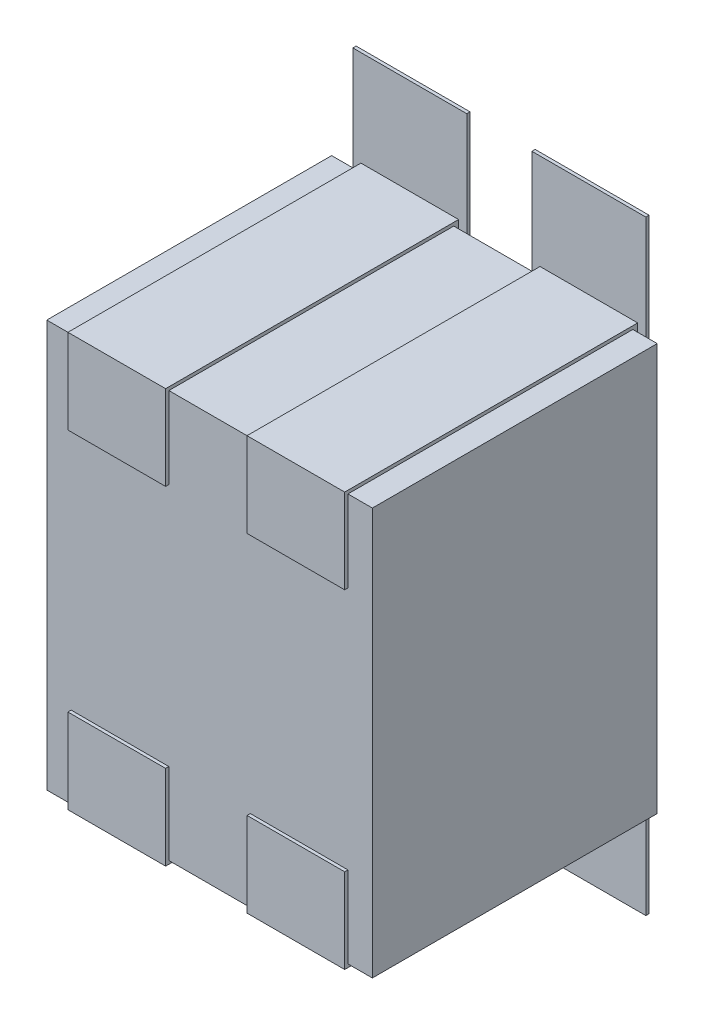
ISO-10303-21;
HEADER;
FILE_DESCRIPTION(('STEP AP214'),'2;1');
FILE_NAME('part.step','',(''),(''),'','','');
FILE_SCHEMA(('AUTOMOTIVE_DESIGN { 1 0 10303 214 1 1 1 1 }'));
ENDSEC;
DATA;
#1=APPLICATION_CONTEXT('core data for automotive mechanical design processes');
#2=APPLICATION_PROTOCOL_DEFINITION('international standard','automotive_design',2000,#1);
#3=PRODUCT_CONTEXT('',#1,'mechanical');
#4=PRODUCT('Part','Part','',(#3));
#5=PRODUCT_RELATED_PRODUCT_CATEGORY('part','',(#4));
#6=PRODUCT_DEFINITION_FORMATION('','',#4);
#7=PRODUCT_DEFINITION_CONTEXT('part definition',#1,'design');
#8=PRODUCT_DEFINITION('design','',#6,#7);
#9=PRODUCT_DEFINITION_SHAPE('','',#8);
#10=(LENGTH_UNIT() NAMED_UNIT(*) SI_UNIT(.MILLI.,.METRE.));
#11=(NAMED_UNIT(*) PLANE_ANGLE_UNIT() SI_UNIT($,.RADIAN.));
#12=(NAMED_UNIT(*) SI_UNIT($,.STERADIAN.) SOLID_ANGLE_UNIT());
#13=UNCERTAINTY_MEASURE_WITH_UNIT(LENGTH_MEASURE(1.E-05),#10,'distance_accuracy_value','');
#14=(GEOMETRIC_REPRESENTATION_CONTEXT(3) GLOBAL_UNCERTAINTY_ASSIGNED_CONTEXT((#13)) GLOBAL_UNIT_ASSIGNED_CONTEXT((#10,
#11,#12)) REPRESENTATION_CONTEXT('',''));
#15=CARTESIAN_POINT('',(0.,0.,0.));
#16=DIRECTION('',(0.,0.,1.));
#17=DIRECTION('',(1.,0.,0.));
#18=AXIS2_PLACEMENT_3D('',#15,#16,#17);
#19=CARTESIAN_POINT('',(0.,0.,0.0762));
#20=DIRECTION('',(0.,0.,1.));
#21=DIRECTION('',(1.,0.,0.));
#22=AXIS2_PLACEMENT_3D('',#19,#20,#21);
#23=PLANE('',#22);
#24=DIRECTION('',(1.,0.,0.));
#25=VECTOR('',#24,1.);
#26=CARTESIAN_POINT('',(-0.449999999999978,0.248999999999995,0.0762));
#27=LINE('',#26,#25);
#28=CARTESIAN_POINT('',(-0.449999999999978,0.248999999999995,0.0762));
#29=VERTEX_POINT('',#28);
#30=CARTESIAN_POINT('',(-0.100000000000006,0.248999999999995,0.0762));
#31=VERTEX_POINT('',#30);
#32=EDGE_CURVE('E343',#29,#31,#27,.T.);
#33=ORIENTED_EDGE('',*,*,#32,.F.);
#34=DIRECTION('',(0.,1.,0.));
#35=VECTOR('',#34,1.);
#36=CARTESIAN_POINT('',(-0.449999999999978,0.929000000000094,0.0762));
#37=LINE('',#36,#35);
#38=CARTESIAN_POINT('',(-0.449999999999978,0.929000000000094,0.0762));
#39=VERTEX_POINT('',#38);
#40=EDGE_CURVE('E19',#39,#29,#37,.F.);
#41=ORIENTED_EDGE('',*,*,#40,.F.);
#42=DIRECTION('',(1.,0.,0.));
#43=VECTOR('',#42,1.);
#44=CARTESIAN_POINT('',(-0.100000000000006,0.929000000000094,0.0762));
#45=LINE('',#44,#43);
#46=CARTESIAN_POINT('',(-0.100000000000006,0.929000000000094,0.0762));
#47=VERTEX_POINT('',#46);
#48=EDGE_CURVE('E371',#47,#39,#45,.F.);
#49=ORIENTED_EDGE('',*,*,#48,.F.);
#50=DIRECTION('',(0.,1.,0.));
#51=VECTOR('',#50,1.);
#52=CARTESIAN_POINT('',(-0.100000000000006,0.248999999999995,0.0762));
#53=LINE('',#52,#51);
#54=EDGE_CURVE('E356',#31,#47,#53,.T.);
#55=ORIENTED_EDGE('',*,*,#54,.F.);
#56=EDGE_LOOP('',(#33,#41,#49,#55));
#57=FACE_BOUND('',#56,.T.);
#58=ADVANCED_FACE('F16',(#57),#23,.F.);
#59=CARTESIAN_POINT('',(0.,0.,0.0762));
#60=DIRECTION('',(0.,0.,1.));
#61=DIRECTION('',(1.,0.,0.));
#62=AXIS2_PLACEMENT_3D('',#59,#60,#61);
#63=PLANE('',#62);
#64=DIRECTION('',(1.,0.,0.));
#65=VECTOR('',#64,1.);
#66=CARTESIAN_POINT('',(0.100000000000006,0.248999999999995,0.0762));
#67=LINE('',#66,#65);
#68=CARTESIAN_POINT('',(0.100000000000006,0.248999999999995,0.0762));
#69=VERTEX_POINT('',#68);
#70=CARTESIAN_POINT('',(0.449999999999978,0.248999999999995,0.0762));
#71=VERTEX_POINT('',#70);
#72=EDGE_CURVE('E378',#69,#71,#67,.T.);
#73=ORIENTED_EDGE('',*,*,#72,.F.);
#74=DIRECTION('',(0.,1.,0.));
#75=VECTOR('',#74,1.);
#76=CARTESIAN_POINT('',(0.100000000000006,0.929000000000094,0.0762));
#77=LINE('',#76,#75);
#78=CARTESIAN_POINT('',(0.100000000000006,0.929000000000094,0.0762));
#79=VERTEX_POINT('',#78);
#80=EDGE_CURVE('E373',#79,#69,#77,.F.);
#81=ORIENTED_EDGE('',*,*,#80,.F.);
#82=DIRECTION('',(1.,0.,0.));
#83=VECTOR('',#82,1.);
#84=CARTESIAN_POINT('',(0.449999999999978,0.929000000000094,0.0762));
#85=LINE('',#84,#83);
#86=CARTESIAN_POINT('',(0.449999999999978,0.929000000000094,0.0762));
#87=VERTEX_POINT('',#86);
#88=EDGE_CURVE('E391',#87,#79,#85,.F.);
#89=ORIENTED_EDGE('',*,*,#88,.F.);
#90=DIRECTION('',(0.,1.,0.));
#91=VECTOR('',#90,1.);
#92=CARTESIAN_POINT('',(0.449999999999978,0.248999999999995,0.0762));
#93=LINE('',#92,#91);
#94=EDGE_CURVE('E383',#71,#87,#93,.T.);
#95=ORIENTED_EDGE('',*,*,#94,.F.);
#96=EDGE_LOOP('',(#73,#81,#89,#95));
#97=FACE_BOUND('',#96,.T.);
#98=ADVANCED_FACE('F1037',(#97),#63,.F.);
#99=CARTESIAN_POINT('',(0.,0.,0.0762));
#100=DIRECTION('',(0.,0.,1.));
#101=DIRECTION('',(1.,0.,0.));
#102=AXIS2_PLACEMENT_3D('',#99,#100,#101);
#103=PLANE('',#102);
#104=DIRECTION('',(1.,0.,0.));
#105=VECTOR('',#104,1.);
#106=CARTESIAN_POINT('',(0.449999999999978,-0.248999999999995,0.0762));
#107=LINE('',#106,#105);
#108=CARTESIAN_POINT('',(0.449999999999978,-0.248999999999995,0.0762));
#109=VERTEX_POINT('',#108);
#110=CARTESIAN_POINT('',(0.100000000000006,-0.248999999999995,0.0762));
#111=VERTEX_POINT('',#110);
#112=EDGE_CURVE('E399',#109,#111,#107,.F.);
#113=ORIENTED_EDGE('',*,*,#112,.F.);
#114=DIRECTION('',(0.,1.,0.));
#115=VECTOR('',#114,1.);
#116=CARTESIAN_POINT('',(0.449999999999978,-0.929000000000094,0.0762));
#117=LINE('',#116,#115);
#118=CARTESIAN_POINT('',(0.449999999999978,-0.929000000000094,0.0762));
#119=VERTEX_POINT('',#118);
#120=EDGE_CURVE('E394',#119,#109,#117,.T.);
#121=ORIENTED_EDGE('',*,*,#120,.F.);
#122=DIRECTION('',(1.,0.,0.));
#123=VECTOR('',#122,1.);
#124=CARTESIAN_POINT('',(0.100000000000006,-0.929000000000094,0.0762));
#125=LINE('',#124,#123);
#126=CARTESIAN_POINT('',(0.100000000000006,-0.929000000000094,0.0762));
#127=VERTEX_POINT('',#126);
#128=EDGE_CURVE('E412',#127,#119,#125,.T.);
#129=ORIENTED_EDGE('',*,*,#128,.F.);
#130=DIRECTION('',(0.,1.,0.));
#131=VECTOR('',#130,1.);
#132=CARTESIAN_POINT('',(0.100000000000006,-0.248999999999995,0.0762));
#133=LINE('',#132,#131);
#134=EDGE_CURVE('E404',#111,#127,#133,.F.);
#135=ORIENTED_EDGE('',*,*,#134,.F.);
#136=EDGE_LOOP('',(#113,#121,#129,#135));
#137=FACE_BOUND('',#136,.T.);
#138=ADVANCED_FACE('F1042',(#137),#103,.F.);
#139=CARTESIAN_POINT('',(0.,0.,0.0762));
#140=DIRECTION('',(0.,0.,1.));
#141=DIRECTION('',(1.,0.,0.));
#142=AXIS2_PLACEMENT_3D('',#139,#140,#141);
#143=PLANE('',#142);
#144=DIRECTION('',(1.,0.,0.));
#145=VECTOR('',#144,1.);
#146=CARTESIAN_POINT('',(-0.100000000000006,-0.248999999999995,0.0762));
#147=LINE('',#146,#145);
#148=CARTESIAN_POINT('',(-0.100000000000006,-0.248999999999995,0.0762));
#149=VERTEX_POINT('',#148);
#150=CARTESIAN_POINT('',(-0.449999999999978,-0.248999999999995,0.0762));
#151=VERTEX_POINT('',#150);
#152=EDGE_CURVE('E420',#149,#151,#147,.F.);
#153=ORIENTED_EDGE('',*,*,#152,.F.);
#154=DIRECTION('',(0.,1.,0.));
#155=VECTOR('',#154,1.);
#156=CARTESIAN_POINT('',(-0.100000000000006,-0.929000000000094,0.0762));
#157=LINE('',#156,#155);
#158=CARTESIAN_POINT('',(-0.100000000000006,-0.929000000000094,0.0762));
#159=VERTEX_POINT('',#158);
#160=EDGE_CURVE('E415',#159,#149,#157,.T.);
#161=ORIENTED_EDGE('',*,*,#160,.F.);
#162=DIRECTION('',(1.,0.,0.));
#163=VECTOR('',#162,1.);
#164=CARTESIAN_POINT('',(-0.449999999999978,-0.929000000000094,0.0762));
#165=LINE('',#164,#163);
#166=CARTESIAN_POINT('',(-0.449999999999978,-0.929000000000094,0.0762));
#167=VERTEX_POINT('',#166);
#168=EDGE_CURVE('E433',#167,#159,#165,.T.);
#169=ORIENTED_EDGE('',*,*,#168,.F.);
#170=DIRECTION('',(0.,1.,0.));
#171=VECTOR('',#170,1.);
#172=CARTESIAN_POINT('',(-0.449999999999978,-0.248999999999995,0.0762));
#173=LINE('',#172,#171);
#174=EDGE_CURVE('E425',#151,#167,#173,.F.);
#175=ORIENTED_EDGE('',*,*,#174,.F.);
#176=EDGE_LOOP('',(#153,#161,#169,#175));
#177=FACE_BOUND('',#176,.T.);
#178=ADVANCED_FACE('F1047',(#177),#143,.F.);
#179=CARTESIAN_POINT('',(-0.449999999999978,0.929000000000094,0.0762));
#180=DIRECTION('',(-1.,0.,0.));
#181=DIRECTION('',(0.,0.,1.));
#182=AXIS2_PLACEMENT_3D('',#179,#180,#181);
#183=PLANE('',#182);
#184=DIRECTION('',(0.,0.,1.));
#185=VECTOR('',#184,1.);
#186=CARTESIAN_POINT('',(-0.449999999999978,0.929000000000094,0.0762));
#187=LINE('',#186,#185);
#188=CARTESIAN_POINT('',(-0.449999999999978,0.929000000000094,0.0862000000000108));
#189=VERTEX_POINT('',#188);
#190=EDGE_CURVE('E352',#39,#189,#187,.T.);
#191=ORIENTED_EDGE('',*,*,#190,.F.);
#192=ORIENTED_EDGE('',*,*,#40,.T.);
#193=DIRECTION('',(0.,0.,-1.));
#194=VECTOR('',#193,1.);
#195=CARTESIAN_POINT('',(-0.449999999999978,0.248999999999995,0.0762));
#196=LINE('',#195,#194);
#197=CARTESIAN_POINT('',(-0.449999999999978,0.248999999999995,0.0862000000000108));
#198=VERTEX_POINT('',#197);
#199=EDGE_CURVE('E349',#198,#29,#196,.T.);
#200=ORIENTED_EDGE('',*,*,#199,.F.);
#201=DIRECTION('',(0.,1.,0.));
#202=VECTOR('',#201,1.);
#203=CARTESIAN_POINT('',(-0.449999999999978,0.,0.0862000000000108));
#204=LINE('',#203,#202);
#205=EDGE_CURVE('E438',#189,#198,#204,.F.);
#206=ORIENTED_EDGE('',*,*,#205,.F.);
#207=EDGE_LOOP('',(#191,#192,#200,#206));
#208=FACE_BOUND('',#207,.T.);
#209=ADVANCED_FACE('F348',(#208),#183,.T.);
#210=CARTESIAN_POINT('',(-0.449999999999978,0.248999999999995,0.0762));
#211=DIRECTION('',(0.,-1.,0.));
#212=DIRECTION('',(0.,0.,-1.));
#213=AXIS2_PLACEMENT_3D('',#210,#211,#212);
#214=PLANE('',#213);
#215=ORIENTED_EDGE('',*,*,#199,.T.);
#216=ORIENTED_EDGE('',*,*,#32,.T.);
#217=DIRECTION('',(0.,0.,-1.));
#218=VECTOR('',#217,1.);
#219=CARTESIAN_POINT('',(-0.100000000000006,0.248999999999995,0.0762));
#220=LINE('',#219,#218);
#221=CARTESIAN_POINT('',(-0.100000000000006,0.248999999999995,0.0862000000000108));
#222=VERTEX_POINT('',#221);
#223=EDGE_CURVE('E358',#222,#31,#220,.T.);
#224=ORIENTED_EDGE('',*,*,#223,.F.);
#225=DIRECTION('',(1.,0.,0.));
#226=VECTOR('',#225,1.);
#227=CARTESIAN_POINT('',(0.,0.248999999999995,0.0862000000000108));
#228=LINE('',#227,#226);
#229=EDGE_CURVE('E362',#198,#222,#228,.T.);
#230=ORIENTED_EDGE('',*,*,#229,.F.);
#231=EDGE_LOOP('',(#215,#216,#224,#230));
#232=FACE_BOUND('',#231,.T.);
#233=ADVANCED_FACE('F360',(#232),#214,.T.);
#234=CARTESIAN_POINT('',(-0.100000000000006,0.248999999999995,0.0762));
#235=DIRECTION('',(1.,0.,0.));
#236=DIRECTION('',(0.,0.,-1.));
#237=AXIS2_PLACEMENT_3D('',#234,#235,#236);
#238=PLANE('',#237);
#239=ORIENTED_EDGE('',*,*,#223,.T.);
#240=ORIENTED_EDGE('',*,*,#54,.T.);
#241=DIRECTION('',(0.,0.,1.));
#242=VECTOR('',#241,1.);
#243=CARTESIAN_POINT('',(-0.100000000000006,0.929000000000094,0.0762));
#244=LINE('',#243,#242);
#245=CARTESIAN_POINT('',(-0.100000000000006,0.929000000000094,0.0862000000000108));
#246=VERTEX_POINT('',#245);
#247=EDGE_CURVE('E368',#246,#47,#244,.F.);
#248=ORIENTED_EDGE('',*,*,#247,.F.);
#249=DIRECTION('',(0.,1.,0.));
#250=VECTOR('',#249,1.);
#251=CARTESIAN_POINT('',(-0.100000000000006,0.,0.0862000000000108));
#252=LINE('',#251,#250);
#253=EDGE_CURVE('E441',#222,#246,#252,.T.);
#254=ORIENTED_EDGE('',*,*,#253,.F.);
#255=EDGE_LOOP('',(#239,#240,#248,#254));
#256=FACE_BOUND('',#255,.T.);
#257=ADVANCED_FACE('F872',(#256),#238,.T.);
#258=CARTESIAN_POINT('',(-0.100000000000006,0.929000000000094,0.0762));
#259=DIRECTION('',(0.,1.,0.));
#260=DIRECTION('',(0.,0.,1.));
#261=AXIS2_PLACEMENT_3D('',#258,#259,#260);
#262=PLANE('',#261);
#263=ORIENTED_EDGE('',*,*,#247,.T.);
#264=ORIENTED_EDGE('',*,*,#48,.T.);
#265=ORIENTED_EDGE('',*,*,#190,.T.);
#266=DIRECTION('',(1.,0.,0.));
#267=VECTOR('',#266,1.);
#268=CARTESIAN_POINT('',(0.,0.929000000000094,0.0862000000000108));
#269=LINE('',#268,#267);
#270=EDGE_CURVE('E444',#246,#189,#269,.F.);
#271=ORIENTED_EDGE('',*,*,#270,.F.);
#272=EDGE_LOOP('',(#263,#264,#265,#271));
#273=FACE_BOUND('',#272,.T.);
#274=ADVANCED_FACE('F874',(#273),#262,.T.);
#275=CARTESIAN_POINT('',(0.100000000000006,0.929000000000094,0.0762));
#276=DIRECTION('',(-1.,0.,0.));
#277=DIRECTION('',(0.,0.,1.));
#278=AXIS2_PLACEMENT_3D('',#275,#276,#277);
#279=PLANE('',#278);
#280=DIRECTION('',(0.,0.,1.));
#281=VECTOR('',#280,1.);
#282=CARTESIAN_POINT('',(0.100000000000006,0.929000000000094,0.0762));
#283=LINE('',#282,#281);
#284=CARTESIAN_POINT('',(0.100000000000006,0.929000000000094,0.0862000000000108));
#285=VERTEX_POINT('',#284);
#286=EDGE_CURVE('E385',#79,#285,#283,.T.);
#287=ORIENTED_EDGE('',*,*,#286,.F.);
#288=ORIENTED_EDGE('',*,*,#80,.T.);
#289=DIRECTION('',(0.,0.,-1.));
#290=VECTOR('',#289,1.);
#291=CARTESIAN_POINT('',(0.100000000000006,0.248999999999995,0.0762));
#292=LINE('',#291,#290);
#293=CARTESIAN_POINT('',(0.100000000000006,0.248999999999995,0.0862000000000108));
#294=VERTEX_POINT('',#293);
#295=EDGE_CURVE('E375',#294,#69,#292,.T.);
#296=ORIENTED_EDGE('',*,*,#295,.F.);
#297=DIRECTION('',(0.,1.,0.));
#298=VECTOR('',#297,1.);
#299=CARTESIAN_POINT('',(0.100000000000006,0.,0.0862000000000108));
#300=LINE('',#299,#298);
#301=EDGE_CURVE('E452',#285,#294,#300,.F.);
#302=ORIENTED_EDGE('',*,*,#301,.F.);
#303=EDGE_LOOP('',(#287,#288,#296,#302));
#304=FACE_BOUND('',#303,.T.);
#305=ADVANCED_FACE('F876',(#304),#279,.T.);
#306=CARTESIAN_POINT('',(0.100000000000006,0.248999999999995,0.0762));
#307=DIRECTION('',(0.,-1.,0.));
#308=DIRECTION('',(0.,0.,-1.));
#309=AXIS2_PLACEMENT_3D('',#306,#307,#308);
#310=PLANE('',#309);
#311=ORIENTED_EDGE('',*,*,#295,.T.);
#312=ORIENTED_EDGE('',*,*,#72,.T.);
#313=DIRECTION('',(0.,0.,-1.));
#314=VECTOR('',#313,1.);
#315=CARTESIAN_POINT('',(0.449999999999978,0.248999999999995,0.0762));
#316=LINE('',#315,#314);
#317=CARTESIAN_POINT('',(0.449999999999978,0.248999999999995,0.0862000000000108));
#318=VERTEX_POINT('',#317);
#319=EDGE_CURVE('E380',#318,#71,#316,.T.);
#320=ORIENTED_EDGE('',*,*,#319,.F.);
#321=DIRECTION('',(1.,0.,0.));
#322=VECTOR('',#321,1.);
#323=CARTESIAN_POINT('',(0.,0.248999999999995,0.0862000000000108));
#324=LINE('',#323,#322);
#325=EDGE_CURVE('E455',#294,#318,#324,.T.);
#326=ORIENTED_EDGE('',*,*,#325,.F.);
#327=EDGE_LOOP('',(#311,#312,#320,#326));
#328=FACE_BOUND('',#327,.T.);
#329=ADVANCED_FACE('F883',(#328),#310,.T.);
#330=CARTESIAN_POINT('',(0.449999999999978,0.248999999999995,0.0762));
#331=DIRECTION('',(1.,0.,0.));
#332=DIRECTION('',(0.,0.,-1.));
#333=AXIS2_PLACEMENT_3D('',#330,#331,#332);
#334=PLANE('',#333);
#335=ORIENTED_EDGE('',*,*,#319,.T.);
#336=ORIENTED_EDGE('',*,*,#94,.T.);
#337=DIRECTION('',(0.,0.,1.));
#338=VECTOR('',#337,1.);
#339=CARTESIAN_POINT('',(0.449999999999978,0.929000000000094,0.0762));
#340=LINE('',#339,#338);
#341=CARTESIAN_POINT('',(0.449999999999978,0.929000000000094,0.0862000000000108));
#342=VERTEX_POINT('',#341);
#343=EDGE_CURVE('E388',#342,#87,#340,.F.);
#344=ORIENTED_EDGE('',*,*,#343,.F.);
#345=DIRECTION('',(0.,1.,0.));
#346=VECTOR('',#345,1.);
#347=CARTESIAN_POINT('',(0.449999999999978,0.,0.0862000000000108));
#348=LINE('',#347,#346);
#349=EDGE_CURVE('E458',#318,#342,#348,.T.);
#350=ORIENTED_EDGE('',*,*,#349,.F.);
#351=EDGE_LOOP('',(#335,#336,#344,#350));
#352=FACE_BOUND('',#351,.T.);
#353=ADVANCED_FACE('F1022',(#352),#334,.T.);
#354=CARTESIAN_POINT('',(0.449999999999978,0.929000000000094,0.0762));
#355=DIRECTION('',(0.,1.,0.));
#356=DIRECTION('',(0.,0.,1.));
#357=AXIS2_PLACEMENT_3D('',#354,#355,#356);
#358=PLANE('',#357);
#359=ORIENTED_EDGE('',*,*,#343,.T.);
#360=ORIENTED_EDGE('',*,*,#88,.T.);
#361=ORIENTED_EDGE('',*,*,#286,.T.);
#362=DIRECTION('',(1.,0.,0.));
#363=VECTOR('',#362,1.);
#364=CARTESIAN_POINT('',(0.,0.929000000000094,0.0862000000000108));
#365=LINE('',#364,#363);
#366=EDGE_CURVE('E461',#342,#285,#365,.F.);
#367=ORIENTED_EDGE('',*,*,#366,.F.);
#368=EDGE_LOOP('',(#359,#360,#361,#367));
#369=FACE_BOUND('',#368,.T.);
#370=ADVANCED_FACE('F1018',(#369),#358,.T.);
#371=CARTESIAN_POINT('',(0.449999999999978,-0.929000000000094,0.0762));
#372=DIRECTION('',(1.,0.,0.));
#373=DIRECTION('',(0.,0.,-1.));
#374=AXIS2_PLACEMENT_3D('',#371,#372,#373);
#375=PLANE('',#374);
#376=DIRECTION('',(0.,0.,-1.));
#377=VECTOR('',#376,1.);
#378=CARTESIAN_POINT('',(0.449999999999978,-0.929000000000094,0.0762));
#379=LINE('',#378,#377);
#380=CARTESIAN_POINT('',(0.449999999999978,-0.929000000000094,0.0862000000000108));
#381=VERTEX_POINT('',#380);
#382=EDGE_CURVE('E406',#119,#381,#379,.F.);
#383=ORIENTED_EDGE('',*,*,#382,.F.);
#384=ORIENTED_EDGE('',*,*,#120,.T.);
#385=DIRECTION('',(0.,0.,1.));
#386=VECTOR('',#385,1.);
#387=CARTESIAN_POINT('',(0.449999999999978,-0.248999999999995,0.0762));
#388=LINE('',#387,#386);
#389=CARTESIAN_POINT('',(0.449999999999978,-0.248999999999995,0.0862000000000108));
#390=VERTEX_POINT('',#389);
#391=EDGE_CURVE('E396',#390,#109,#388,.F.);
#392=ORIENTED_EDGE('',*,*,#391,.F.);
#393=DIRECTION('',(0.,1.,0.));
#394=VECTOR('',#393,1.);
#395=CARTESIAN_POINT('',(0.449999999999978,0.,0.0862000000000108));
#396=LINE('',#395,#394);
#397=EDGE_CURVE('E469',#381,#390,#396,.T.);
#398=ORIENTED_EDGE('',*,*,#397,.F.);
#399=EDGE_LOOP('',(#383,#384,#392,#398));
#400=FACE_BOUND('',#399,.T.);
#401=ADVANCED_FACE('F1014',(#400),#375,.T.);
#402=CARTESIAN_POINT('',(0.449999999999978,-0.248999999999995,0.0762));
#403=DIRECTION('',(0.,1.,0.));
#404=DIRECTION('',(0.,0.,1.));
#405=AXIS2_PLACEMENT_3D('',#402,#403,#404);
#406=PLANE('',#405);
#407=ORIENTED_EDGE('',*,*,#391,.T.);
#408=ORIENTED_EDGE('',*,*,#112,.T.);
#409=DIRECTION('',(0.,0.,1.));
#410=VECTOR('',#409,1.);
#411=CARTESIAN_POINT('',(0.100000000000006,-0.248999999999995,0.0762));
#412=LINE('',#411,#410);
#413=CARTESIAN_POINT('',(0.100000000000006,-0.248999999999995,0.0862000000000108));
#414=VERTEX_POINT('',#413);
#415=EDGE_CURVE('E401',#414,#111,#412,.F.);
#416=ORIENTED_EDGE('',*,*,#415,.F.);
#417=DIRECTION('',(1.,0.,0.));
#418=VECTOR('',#417,1.);
#419=CARTESIAN_POINT('',(0.,-0.248999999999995,0.0862000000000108));
#420=LINE('',#419,#418);
#421=EDGE_CURVE('E472',#390,#414,#420,.F.);
#422=ORIENTED_EDGE('',*,*,#421,.F.);
#423=EDGE_LOOP('',(#407,#408,#416,#422));
#424=FACE_BOUND('',#423,.T.);
#425=ADVANCED_FACE('F1010',(#424),#406,.T.);
#426=CARTESIAN_POINT('',(0.100000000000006,-0.248999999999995,0.0762));
#427=DIRECTION('',(-1.,0.,0.));
#428=DIRECTION('',(0.,0.,1.));
#429=AXIS2_PLACEMENT_3D('',#426,#427,#428);
#430=PLANE('',#429);
#431=ORIENTED_EDGE('',*,*,#415,.T.);
#432=ORIENTED_EDGE('',*,*,#134,.T.);
#433=DIRECTION('',(0.,0.,-1.));
#434=VECTOR('',#433,1.);
#435=CARTESIAN_POINT('',(0.100000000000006,-0.929000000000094,0.0762));
#436=LINE('',#435,#434);
#437=CARTESIAN_POINT('',(0.100000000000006,-0.929000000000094,0.0862000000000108));
#438=VERTEX_POINT('',#437);
#439=EDGE_CURVE('E409',#438,#127,#436,.T.);
#440=ORIENTED_EDGE('',*,*,#439,.F.);
#441=DIRECTION('',(0.,1.,0.));
#442=VECTOR('',#441,1.);
#443=CARTESIAN_POINT('',(0.100000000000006,0.,0.0862000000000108));
#444=LINE('',#443,#442);
#445=EDGE_CURVE('E475',#414,#438,#444,.F.);
#446=ORIENTED_EDGE('',*,*,#445,.F.);
#447=EDGE_LOOP('',(#431,#432,#440,#446));
#448=FACE_BOUND('',#447,.T.);
#449=ADVANCED_FACE('F1006',(#448),#430,.T.);
#450=CARTESIAN_POINT('',(0.100000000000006,-0.929000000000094,0.0762));
#451=DIRECTION('',(0.,-1.,0.));
#452=DIRECTION('',(0.,0.,-1.));
#453=AXIS2_PLACEMENT_3D('',#450,#451,#452);
#454=PLANE('',#453);
#455=ORIENTED_EDGE('',*,*,#439,.T.);
#456=ORIENTED_EDGE('',*,*,#128,.T.);
#457=ORIENTED_EDGE('',*,*,#382,.T.);
#458=DIRECTION('',(1.,0.,0.));
#459=VECTOR('',#458,1.);
#460=CARTESIAN_POINT('',(0.,-0.929000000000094,0.0862000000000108));
#461=LINE('',#460,#459);
#462=EDGE_CURVE('E478',#438,#381,#461,.T.);
#463=ORIENTED_EDGE('',*,*,#462,.F.);
#464=EDGE_LOOP('',(#455,#456,#457,#463));
#465=FACE_BOUND('',#464,.T.);
#466=ADVANCED_FACE('F1002',(#465),#454,.T.);
#467=CARTESIAN_POINT('',(-0.100000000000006,-0.929000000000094,0.0762));
#468=DIRECTION('',(1.,0.,0.));
#469=DIRECTION('',(0.,0.,-1.));
#470=AXIS2_PLACEMENT_3D('',#467,#468,#469);
#471=PLANE('',#470);
#472=DIRECTION('',(0.,0.,-1.));
#473=VECTOR('',#472,1.);
#474=CARTESIAN_POINT('',(-0.100000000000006,-0.929000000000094,0.0762));
#475=LINE('',#474,#473);
#476=CARTESIAN_POINT('',(-0.100000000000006,-0.929000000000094,0.0862000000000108));
#477=VERTEX_POINT('',#476);
#478=EDGE_CURVE('E427',#159,#477,#475,.F.);
#479=ORIENTED_EDGE('',*,*,#478,.F.);
#480=ORIENTED_EDGE('',*,*,#160,.T.);
#481=DIRECTION('',(0.,0.,1.));
#482=VECTOR('',#481,1.);
#483=CARTESIAN_POINT('',(-0.100000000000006,-0.248999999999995,0.0762));
#484=LINE('',#483,#482);
#485=CARTESIAN_POINT('',(-0.100000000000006,-0.248999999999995,0.0862000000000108));
#486=VERTEX_POINT('',#485);
#487=EDGE_CURVE('E417',#486,#149,#484,.F.);
#488=ORIENTED_EDGE('',*,*,#487,.F.);
#489=DIRECTION('',(0.,1.,0.));
#490=VECTOR('',#489,1.);
#491=CARTESIAN_POINT('',(-0.100000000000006,0.,0.0862000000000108));
#492=LINE('',#491,#490);
#493=EDGE_CURVE('E486',#477,#486,#492,.T.);
#494=ORIENTED_EDGE('',*,*,#493,.F.);
#495=EDGE_LOOP('',(#479,#480,#488,#494));
#496=FACE_BOUND('',#495,.T.);
#497=ADVANCED_FACE('F998',(#496),#471,.T.);
#498=CARTESIAN_POINT('',(-0.100000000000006,-0.248999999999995,0.0762));
#499=DIRECTION('',(0.,1.,0.));
#500=DIRECTION('',(0.,0.,1.));
#501=AXIS2_PLACEMENT_3D('',#498,#499,#500);
#502=PLANE('',#501);
#503=ORIENTED_EDGE('',*,*,#487,.T.);
#504=ORIENTED_EDGE('',*,*,#152,.T.);
#505=DIRECTION('',(0.,0.,1.));
#506=VECTOR('',#505,1.);
#507=CARTESIAN_POINT('',(-0.449999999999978,-0.248999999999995,0.0762));
#508=LINE('',#507,#506);
#509=CARTESIAN_POINT('',(-0.449999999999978,-0.248999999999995,0.0862000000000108));
#510=VERTEX_POINT('',#509);
#511=EDGE_CURVE('E422',#510,#151,#508,.F.);
#512=ORIENTED_EDGE('',*,*,#511,.F.);
#513=DIRECTION('',(1.,0.,0.));
#514=VECTOR('',#513,1.);
#515=CARTESIAN_POINT('',(0.,-0.248999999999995,0.0862000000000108));
#516=LINE('',#515,#514);
#517=EDGE_CURVE('E489',#486,#510,#516,.F.);
#518=ORIENTED_EDGE('',*,*,#517,.F.);
#519=EDGE_LOOP('',(#503,#504,#512,#518));
#520=FACE_BOUND('',#519,.T.);
#521=ADVANCED_FACE('F994',(#520),#502,.T.);
#522=CARTESIAN_POINT('',(-0.449999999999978,-0.248999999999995,0.0762));
#523=DIRECTION('',(-1.,0.,0.));
#524=DIRECTION('',(0.,0.,1.));
#525=AXIS2_PLACEMENT_3D('',#522,#523,#524);
#526=PLANE('',#525);
#527=ORIENTED_EDGE('',*,*,#511,.T.);
#528=ORIENTED_EDGE('',*,*,#174,.T.);
#529=DIRECTION('',(0.,0.,-1.));
#530=VECTOR('',#529,1.);
#531=CARTESIAN_POINT('',(-0.449999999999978,-0.929000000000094,0.0762));
#532=LINE('',#531,#530);
#533=CARTESIAN_POINT('',(-0.449999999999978,-0.929000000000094,0.0862000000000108));
#534=VERTEX_POINT('',#533);
#535=EDGE_CURVE('E430',#534,#167,#532,.T.);
#536=ORIENTED_EDGE('',*,*,#535,.F.);
#537=DIRECTION('',(0.,1.,0.));
#538=VECTOR('',#537,1.);
#539=CARTESIAN_POINT('',(-0.449999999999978,0.,0.0862000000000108));
#540=LINE('',#539,#538);
#541=EDGE_CURVE('E492',#510,#534,#540,.F.);
#542=ORIENTED_EDGE('',*,*,#541,.F.);
#543=EDGE_LOOP('',(#527,#528,#536,#542));
#544=FACE_BOUND('',#543,.T.);
#545=ADVANCED_FACE('F990',(#544),#526,.T.);
#546=CARTESIAN_POINT('',(-0.449999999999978,-0.929000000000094,0.0762));
#547=DIRECTION('',(0.,-1.,0.));
#548=DIRECTION('',(0.,0.,-1.));
#549=AXIS2_PLACEMENT_3D('',#546,#547,#548);
#550=PLANE('',#549);
#551=ORIENTED_EDGE('',*,*,#535,.T.);
#552=ORIENTED_EDGE('',*,*,#168,.T.);
#553=ORIENTED_EDGE('',*,*,#478,.T.);
#554=DIRECTION('',(1.,0.,0.));
#555=VECTOR('',#554,1.);
#556=CARTESIAN_POINT('',(0.,-0.929000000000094,0.0862000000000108));
#557=LINE('',#556,#555);
#558=EDGE_CURVE('E495',#534,#477,#557,.T.);
#559=ORIENTED_EDGE('',*,*,#558,.F.);
#560=EDGE_LOOP('',(#551,#552,#553,#559));
#561=FACE_BOUND('',#560,.T.);
#562=ADVANCED_FACE('F987',(#561),#550,.T.);
#563=CARTESIAN_POINT('',(-0.125000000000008,0.635,0.0762));
#564=DIRECTION('',(0.,1.,0.));
#565=DIRECTION('',(0.,0.,1.));
#566=AXIS2_PLACEMENT_3D('',#563,#564,#565);
#567=PLANE('',#566);
#568=DIRECTION('',(0.,0.,-1.));
#569=VECTOR('',#568,1.);
#570=CARTESIAN_POINT('',(-0.125000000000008,0.635,0.0762));
#571=LINE('',#570,#569);
#572=CARTESIAN_POINT('',(-0.125000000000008,0.635,0.0862000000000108));
#573=VERTEX_POINT('',#572);
#574=CARTESIAN_POINT('',(-0.125000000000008,0.635,0.98612199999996));
#575=VERTEX_POINT('',#574);
#576=EDGE_CURVE('E527',#573,#575,#571,.F.);
#577=ORIENTED_EDGE('',*,*,#576,.F.);
#578=DIRECTION('',(1.,0.,0.));
#579=VECTOR('',#578,1.);
#580=CARTESIAN_POINT('',(0.,0.635,0.0862000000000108));
#581=LINE('',#580,#579);
#582=CARTESIAN_POINT('',(-0.425000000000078,0.635,0.0862000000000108));
#583=VERTEX_POINT('',#582);
#584=EDGE_CURVE('E447',#583,#573,#581,.T.);
#585=ORIENTED_EDGE('',*,*,#584,.F.);
#586=DIRECTION('',(0.,0.,1.));
#587=VECTOR('',#586,1.);
#588=CARTESIAN_POINT('',(-0.425000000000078,0.635,0.0762));
#589=LINE('',#588,#587);
#590=CARTESIAN_POINT('',(-0.425000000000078,0.635,0.98612199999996));
#591=VERTEX_POINT('',#590);
#592=EDGE_CURVE('E517',#591,#583,#589,.F.);
#593=ORIENTED_EDGE('',*,*,#592,.F.);
#594=DIRECTION('',(1.,0.,0.));
#595=VECTOR('',#594,1.);
#596=CARTESIAN_POINT('',(-0.500000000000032,0.635,0.98612199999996));
#597=LINE('',#596,#595);
#598=EDGE_CURVE('E436',#575,#591,#597,.F.);
#599=ORIENTED_EDGE('',*,*,#598,.F.);
#600=EDGE_LOOP('',(#577,#585,#593,#599));
#601=FACE_BOUND('',#600,.T.);
#602=ADVANCED_FACE('F861',(#601),#567,.T.);
#603=CARTESIAN_POINT('',(-0.500000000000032,-0.62500000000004,0.98612199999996));
#604=DIRECTION('',(0.,0.,1.));
#605=DIRECTION('',(1.,0.,0.));
#606=AXIS2_PLACEMENT_3D('',#603,#604,#605);
#607=PLANE('',#606);
#608=DIRECTION('',(0.,1.,0.));
#609=VECTOR('',#608,1.);
#610=CARTESIAN_POINT('',(-0.125000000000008,0.375000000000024,0.98612199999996));
#611=LINE('',#610,#609);
#612=CARTESIAN_POINT('',(-0.125000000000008,0.375000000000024,0.98612199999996));
#613=VERTEX_POINT('',#612);
#614=EDGE_CURVE('E530',#575,#613,#611,.F.);
#615=ORIENTED_EDGE('',*,*,#614,.F.);
#616=ORIENTED_EDGE('',*,*,#598,.T.);
#617=DIRECTION('',(0.,1.,0.));
#618=VECTOR('',#617,1.);
#619=CARTESIAN_POINT('',(-0.425000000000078,0.635,0.98612199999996));
#620=LINE('',#619,#618);
#621=CARTESIAN_POINT('',(-0.425000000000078,0.375000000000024,0.98612199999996));
#622=VERTEX_POINT('',#621);
#623=EDGE_CURVE('E514',#622,#591,#620,.T.);
#624=ORIENTED_EDGE('',*,*,#623,.F.);
#625=DIRECTION('',(1.,0.,0.));
#626=VECTOR('',#625,1.);
#627=CARTESIAN_POINT('',(-0.425000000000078,0.375000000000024,0.98612199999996));
#628=LINE('',#627,#626);
#629=EDGE_CURVE('E505',#613,#622,#628,.F.);
#630=ORIENTED_EDGE('',*,*,#629,.F.);
#631=EDGE_LOOP('',(#615,#616,#624,#630));
#632=FACE_BOUND('',#631,.T.);
#633=ADVANCED_FACE('F858',(#632),#607,.T.);
#634=CARTESIAN_POINT('',(0.,0.,0.0862000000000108));
#635=DIRECTION('',(0.,0.,1.));
#636=DIRECTION('',(1.,0.,0.));
#637=AXIS2_PLACEMENT_3D('',#634,#635,#636);
#638=PLANE('',#637);
#639=DIRECTION('',(0.,1.,0.));
#640=VECTOR('',#639,1.);
#641=CARTESIAN_POINT('',(-0.425000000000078,0.635,0.0862000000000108));
#642=LINE('',#641,#640);
#643=CARTESIAN_POINT('',(-0.425000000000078,0.375000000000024,0.0862000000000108));
#644=VERTEX_POINT('',#643);
#645=EDGE_CURVE('E520',#583,#644,#642,.F.);
#646=ORIENTED_EDGE('',*,*,#645,.F.);
#647=ORIENTED_EDGE('',*,*,#584,.T.);
#648=DIRECTION('',(0.,1.,0.));
#649=VECTOR('',#648,1.);
#650=CARTESIAN_POINT('',(-0.125000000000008,0.375000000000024,0.0862000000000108));
#651=LINE('',#650,#649);
#652=CARTESIAN_POINT('',(-0.125000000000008,0.375000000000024,0.0862000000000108));
#653=VERTEX_POINT('',#652);
#654=EDGE_CURVE('E538',#653,#573,#651,.T.);
#655=ORIENTED_EDGE('',*,*,#654,.F.);
#656=DIRECTION('',(1.,0.,0.));
#657=VECTOR('',#656,1.);
#658=CARTESIAN_POINT('',(-0.425000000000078,0.375000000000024,0.0862000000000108));
#659=LINE('',#658,#657);
#660=EDGE_CURVE('E525',#644,#653,#659,.T.);
#661=ORIENTED_EDGE('',*,*,#660,.F.);
#662=EDGE_LOOP('',(#646,#647,#655,#661));
#663=FACE_BOUND('',#662,.T.);
#664=ORIENTED_EDGE('',*,*,#253,.T.);
#665=ORIENTED_EDGE('',*,*,#270,.T.);
#666=ORIENTED_EDGE('',*,*,#205,.T.);
#667=ORIENTED_EDGE('',*,*,#229,.T.);
#668=EDGE_LOOP('',(#664,#665,#666,#667));
#669=FACE_BOUND('',#668,.T.);
#670=ADVANCED_FACE('F864',(#663,#669),#638,.T.);
#671=CARTESIAN_POINT('',(0.425000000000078,0.635,0.0762));
#672=DIRECTION('',(0.,1.,0.));
#673=DIRECTION('',(0.,0.,1.));
#674=AXIS2_PLACEMENT_3D('',#671,#672,#673);
#675=PLANE('',#674);
#676=DIRECTION('',(0.,0.,-1.));
#677=VECTOR('',#676,1.);
#678=CARTESIAN_POINT('',(0.425000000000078,0.635,0.0762));
#679=LINE('',#678,#677);
#680=CARTESIAN_POINT('',(0.425000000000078,0.635,0.0862000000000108));
#681=VERTEX_POINT('',#680);
#682=CARTESIAN_POINT('',(0.425000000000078,0.635,0.98612199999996));
#683=VERTEX_POINT('',#682);
#684=EDGE_CURVE('E561',#681,#683,#679,.F.);
#685=ORIENTED_EDGE('',*,*,#684,.F.);
#686=DIRECTION('',(1.,0.,0.));
#687=VECTOR('',#686,1.);
#688=CARTESIAN_POINT('',(0.,0.635,0.0862000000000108));
#689=LINE('',#688,#687);
#690=CARTESIAN_POINT('',(0.125000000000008,0.635,0.0862000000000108));
#691=VERTEX_POINT('',#690);
#692=EDGE_CURVE('E464',#691,#681,#689,.T.);
#693=ORIENTED_EDGE('',*,*,#692,.F.);
#694=DIRECTION('',(0.,0.,1.));
#695=VECTOR('',#694,1.);
#696=CARTESIAN_POINT('',(0.125000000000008,0.635,0.0762));
#697=LINE('',#696,#695);
#698=CARTESIAN_POINT('',(0.125000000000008,0.635,0.98612199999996));
#699=VERTEX_POINT('',#698);
#700=EDGE_CURVE('E551',#699,#691,#697,.F.);
#701=ORIENTED_EDGE('',*,*,#700,.F.);
#702=DIRECTION('',(1.,0.,0.));
#703=VECTOR('',#702,1.);
#704=CARTESIAN_POINT('',(-0.500000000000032,0.635,0.98612199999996));
#705=LINE('',#704,#703);
#706=EDGE_CURVE('E450',#683,#699,#705,.F.);
#707=ORIENTED_EDGE('',*,*,#706,.F.);
#708=EDGE_LOOP('',(#685,#693,#701,#707));
#709=FACE_BOUND('',#708,.T.);
#710=ADVANCED_FACE('F867',(#709),#675,.T.);
#711=CARTESIAN_POINT('',(-0.500000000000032,-0.62500000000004,0.98612199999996));
#712=DIRECTION('',(0.,0.,1.));
#713=DIRECTION('',(1.,0.,0.));
#714=AXIS2_PLACEMENT_3D('',#711,#712,#713);
#715=PLANE('',#714);
#716=ORIENTED_EDGE('',*,*,#706,.T.);
#717=DIRECTION('',(0.,1.,0.));
#718=VECTOR('',#717,1.);
#719=CARTESIAN_POINT('',(0.125000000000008,0.635,0.98612199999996));
#720=LINE('',#719,#718);
#721=CARTESIAN_POINT('',(0.125000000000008,0.375000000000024,0.98612199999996));
#722=VERTEX_POINT('',#721);
#723=EDGE_CURVE('E548',#722,#699,#720,.T.);
#724=ORIENTED_EDGE('',*,*,#723,.F.);
#725=DIRECTION('',(1.,0.,0.));
#726=VECTOR('',#725,1.);
#727=CARTESIAN_POINT('',(0.125000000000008,0.375000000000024,0.98612199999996));
#728=LINE('',#727,#726);
#729=CARTESIAN_POINT('',(0.425000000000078,0.375000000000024,0.98612199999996));
#730=VERTEX_POINT('',#729);
#731=EDGE_CURVE('E503',#730,#722,#728,.F.);
#732=ORIENTED_EDGE('',*,*,#731,.F.);
#733=DIRECTION('',(0.,1.,0.));
#734=VECTOR('',#733,1.);
#735=CARTESIAN_POINT('',(0.425000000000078,0.375000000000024,0.98612199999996));
#736=LINE('',#735,#734);
#737=EDGE_CURVE('E564',#683,#730,#736,.F.);
#738=ORIENTED_EDGE('',*,*,#737,.F.);
#739=EDGE_LOOP('',(#716,#724,#732,#738));
#740=FACE_BOUND('',#739,.T.);
#741=ADVANCED_FACE('F975',(#740),#715,.T.);
#742=CARTESIAN_POINT('',(0.,0.,0.0862000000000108));
#743=DIRECTION('',(0.,0.,1.));
#744=DIRECTION('',(1.,0.,0.));
#745=AXIS2_PLACEMENT_3D('',#742,#743,#744);
#746=PLANE('',#745);
#747=DIRECTION('',(1.,0.,0.));
#748=VECTOR('',#747,1.);
#749=CARTESIAN_POINT('',(0.125000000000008,0.375000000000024,0.0862000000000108));
#750=LINE('',#749,#748);
#751=CARTESIAN_POINT('',(0.125000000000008,0.375000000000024,0.0862000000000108));
#752=VERTEX_POINT('',#751);
#753=CARTESIAN_POINT('',(0.425000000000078,0.375000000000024,0.0862000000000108));
#754=VERTEX_POINT('',#753);
#755=EDGE_CURVE('E559',#752,#754,#750,.T.);
#756=ORIENTED_EDGE('',*,*,#755,.F.);
#757=DIRECTION('',(0.,1.,0.));
#758=VECTOR('',#757,1.);
#759=CARTESIAN_POINT('',(0.125000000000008,0.635,0.0862000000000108));
#760=LINE('',#759,#758);
#761=EDGE_CURVE('E554',#691,#752,#760,.F.);
#762=ORIENTED_EDGE('',*,*,#761,.F.);
#763=ORIENTED_EDGE('',*,*,#692,.T.);
#764=DIRECTION('',(0.,1.,0.));
#765=VECTOR('',#764,1.);
#766=CARTESIAN_POINT('',(0.425000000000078,0.375000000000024,0.0862000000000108));
#767=LINE('',#766,#765);
#768=EDGE_CURVE('E572',#754,#681,#767,.T.);
#769=ORIENTED_EDGE('',*,*,#768,.F.);
#770=EDGE_LOOP('',(#756,#762,#763,#769));
#771=FACE_BOUND('',#770,.T.);
#772=ORIENTED_EDGE('',*,*,#349,.T.);
#773=ORIENTED_EDGE('',*,*,#366,.T.);
#774=ORIENTED_EDGE('',*,*,#301,.T.);
#775=ORIENTED_EDGE('',*,*,#325,.T.);
#776=EDGE_LOOP('',(#772,#773,#774,#775));
#777=FACE_BOUND('',#776,.T.);
#778=ADVANCED_FACE('F971',(#771,#777),#746,.T.);
#779=CARTESIAN_POINT('',(0.125000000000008,-0.635,0.0762));
#780=DIRECTION('',(0.,-1.,0.));
#781=DIRECTION('',(0.,0.,-1.));
#782=AXIS2_PLACEMENT_3D('',#779,#780,#781);
#783=PLANE('',#782);
#784=DIRECTION('',(0.,0.,1.));
#785=VECTOR('',#784,1.);
#786=CARTESIAN_POINT('',(0.125000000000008,-0.635,0.0762));
#787=LINE('',#786,#785);
#788=CARTESIAN_POINT('',(0.125000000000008,-0.635,0.0862000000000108));
#789=VERTEX_POINT('',#788);
#790=CARTESIAN_POINT('',(0.125000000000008,-0.635,0.98612199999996));
#791=VERTEX_POINT('',#790);
#792=EDGE_CURVE('E599',#789,#791,#787,.T.);
#793=ORIENTED_EDGE('',*,*,#792,.F.);
#794=DIRECTION('',(1.,0.,0.));
#795=VECTOR('',#794,1.);
#796=CARTESIAN_POINT('',(0.,-0.635,0.0862000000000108));
#797=LINE('',#796,#795);
#798=CARTESIAN_POINT('',(0.425000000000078,-0.635,0.0862000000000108));
#799=VERTEX_POINT('',#798);
#800=EDGE_CURVE('E481',#799,#789,#797,.F.);
#801=ORIENTED_EDGE('',*,*,#800,.F.);
#802=DIRECTION('',(0.,0.,-1.));
#803=VECTOR('',#802,1.);
#804=CARTESIAN_POINT('',(0.425000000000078,-0.635,0.0762));
#805=LINE('',#804,#803);
#806=CARTESIAN_POINT('',(0.425000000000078,-0.635,0.98612199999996));
#807=VERTEX_POINT('',#806);
#808=EDGE_CURVE('E589',#807,#799,#805,.T.);
#809=ORIENTED_EDGE('',*,*,#808,.F.);
#810=DIRECTION('',(1.,0.,0.));
#811=VECTOR('',#810,1.);
#812=CARTESIAN_POINT('',(-0.500000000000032,-0.635,0.98612199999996));
#813=LINE('',#812,#811);
#814=EDGE_CURVE('E467',#791,#807,#813,.T.);
#815=ORIENTED_EDGE('',*,*,#814,.F.);
#816=EDGE_LOOP('',(#793,#801,#809,#815));
#817=FACE_BOUND('',#816,.T.);
#818=ADVANCED_FACE('F967',(#817),#783,.T.);
#819=CARTESIAN_POINT('',(-0.500000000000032,-0.62500000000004,0.98612199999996));
#820=DIRECTION('',(0.,0.,1.));
#821=DIRECTION('',(1.,0.,0.));
#822=AXIS2_PLACEMENT_3D('',#819,#820,#821);
#823=PLANE('',#822);
#824=DIRECTION('',(0.,1.,0.));
#825=VECTOR('',#824,1.);
#826=CARTESIAN_POINT('',(0.125000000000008,-0.375000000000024,0.98612199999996));
#827=LINE('',#826,#825);
#828=CARTESIAN_POINT('',(0.125000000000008,-0.375000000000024,0.98612199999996));
#829=VERTEX_POINT('',#828);
#830=EDGE_CURVE('E602',#791,#829,#827,.T.);
#831=ORIENTED_EDGE('',*,*,#830,.F.);
#832=ORIENTED_EDGE('',*,*,#814,.T.);
#833=DIRECTION('',(0.,1.,0.));
#834=VECTOR('',#833,1.);
#835=CARTESIAN_POINT('',(0.425000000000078,-0.635,0.98612199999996));
#836=LINE('',#835,#834);
#837=CARTESIAN_POINT('',(0.425000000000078,-0.375000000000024,0.98612199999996));
#838=VERTEX_POINT('',#837);
#839=EDGE_CURVE('E586',#838,#807,#836,.F.);
#840=ORIENTED_EDGE('',*,*,#839,.F.);
#841=DIRECTION('',(1.,0.,0.));
#842=VECTOR('',#841,1.);
#843=CARTESIAN_POINT('',(0.425000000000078,-0.375000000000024,0.98612199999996));
#844=LINE('',#843,#842);
#845=EDGE_CURVE('E501',#829,#838,#844,.T.);
#846=ORIENTED_EDGE('',*,*,#845,.F.);
#847=EDGE_LOOP('',(#831,#832,#840,#846));
#848=FACE_BOUND('',#847,.T.);
#849=ADVANCED_FACE('F963',(#848),#823,.T.);
#850=CARTESIAN_POINT('',(0.,0.,0.0862000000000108));
#851=DIRECTION('',(0.,0.,1.));
#852=DIRECTION('',(1.,0.,0.));
#853=AXIS2_PLACEMENT_3D('',#850,#851,#852);
#854=PLANE('',#853);
#855=DIRECTION('',(0.,1.,0.));
#856=VECTOR('',#855,1.);
#857=CARTESIAN_POINT('',(0.425000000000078,-0.635,0.0862000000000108));
#858=LINE('',#857,#856);
#859=CARTESIAN_POINT('',(0.425000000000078,-0.375000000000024,0.0862000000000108));
#860=VERTEX_POINT('',#859);
#861=EDGE_CURVE('E592',#799,#860,#858,.T.);
#862=ORIENTED_EDGE('',*,*,#861,.F.);
#863=ORIENTED_EDGE('',*,*,#800,.T.);
#864=DIRECTION('',(0.,1.,0.));
#865=VECTOR('',#864,1.);
#866=CARTESIAN_POINT('',(0.125000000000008,-0.375000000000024,0.0862000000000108));
#867=LINE('',#866,#865);
#868=CARTESIAN_POINT('',(0.125000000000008,-0.375000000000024,0.0862000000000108));
#869=VERTEX_POINT('',#868);
#870=EDGE_CURVE('E610',#869,#789,#867,.F.);
#871=ORIENTED_EDGE('',*,*,#870,.F.);
#872=DIRECTION('',(1.,0.,0.));
#873=VECTOR('',#872,1.);
#874=CARTESIAN_POINT('',(0.425000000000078,-0.375000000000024,0.0862000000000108));
#875=LINE('',#874,#873);
#876=EDGE_CURVE('E597',#860,#869,#875,.F.);
#877=ORIENTED_EDGE('',*,*,#876,.F.);
#878=EDGE_LOOP('',(#862,#863,#871,#877));
#879=FACE_BOUND('',#878,.T.);
#880=ORIENTED_EDGE('',*,*,#445,.T.);
#881=ORIENTED_EDGE('',*,*,#462,.T.);
#882=ORIENTED_EDGE('',*,*,#397,.T.);
#883=ORIENTED_EDGE('',*,*,#421,.T.);
#884=EDGE_LOOP('',(#880,#881,#882,#883));
#885=FACE_BOUND('',#884,.T.);
#886=ADVANCED_FACE('F959',(#879,#885),#854,.T.);
#887=CARTESIAN_POINT('',(-0.425000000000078,-0.635,0.0762));
#888=DIRECTION('',(0.,-1.,0.));
#889=DIRECTION('',(0.,0.,-1.));
#890=AXIS2_PLACEMENT_3D('',#887,#888,#889);
#891=PLANE('',#890);
#892=DIRECTION('',(0.,0.,1.));
#893=VECTOR('',#892,1.);
#894=CARTESIAN_POINT('',(-0.425000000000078,-0.635,0.0762));
#895=LINE('',#894,#893);
#896=CARTESIAN_POINT('',(-0.425000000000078,-0.635,0.0862000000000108));
#897=VERTEX_POINT('',#896);
#898=CARTESIAN_POINT('',(-0.425000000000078,-0.635,0.98612199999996));
#899=VERTEX_POINT('',#898);
#900=EDGE_CURVE('E633',#897,#899,#895,.T.);
#901=ORIENTED_EDGE('',*,*,#900,.F.);
#902=DIRECTION('',(1.,0.,0.));
#903=VECTOR('',#902,1.);
#904=CARTESIAN_POINT('',(0.,-0.635,0.0862000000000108));
#905=LINE('',#904,#903);
#906=CARTESIAN_POINT('',(-0.125000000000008,-0.635,0.0862000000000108));
#907=VERTEX_POINT('',#906);
#908=EDGE_CURVE('E498',#907,#897,#905,.F.);
#909=ORIENTED_EDGE('',*,*,#908,.F.);
#910=DIRECTION('',(0.,0.,-1.));
#911=VECTOR('',#910,1.);
#912=CARTESIAN_POINT('',(-0.125000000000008,-0.635,0.0762));
#913=LINE('',#912,#911);
#914=CARTESIAN_POINT('',(-0.125000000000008,-0.635,0.98612199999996));
#915=VERTEX_POINT('',#914);
#916=EDGE_CURVE('E627',#915,#907,#913,.T.);
#917=ORIENTED_EDGE('',*,*,#916,.F.);
#918=DIRECTION('',(1.,0.,0.));
#919=VECTOR('',#918,1.);
#920=CARTESIAN_POINT('',(-0.500000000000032,-0.635,0.98612199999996));
#921=LINE('',#920,#919);
#922=EDGE_CURVE('E484',#899,#915,#921,.T.);
#923=ORIENTED_EDGE('',*,*,#922,.F.);
#924=EDGE_LOOP('',(#901,#909,#917,#923));
#925=FACE_BOUND('',#924,.T.);
#926=ADVANCED_FACE('F955',(#925),#891,.T.);
#927=CARTESIAN_POINT('',(-0.500000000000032,-0.62500000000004,0.98612199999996));
#928=DIRECTION('',(0.,0.,1.));
#929=DIRECTION('',(1.,0.,0.));
#930=AXIS2_PLACEMENT_3D('',#927,#928,#929);
#931=PLANE('',#930);
#932=ORIENTED_EDGE('',*,*,#922,.T.);
#933=DIRECTION('',(0.,1.,0.));
#934=VECTOR('',#933,1.);
#935=CARTESIAN_POINT('',(-0.125000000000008,-0.635,0.98612199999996));
#936=LINE('',#935,#934);
#937=CARTESIAN_POINT('',(-0.125000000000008,-0.375000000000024,0.98612199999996));
#938=VERTEX_POINT('',#937);
#939=EDGE_CURVE('E624',#938,#915,#936,.F.);
#940=ORIENTED_EDGE('',*,*,#939,.F.);
#941=DIRECTION('',(1.,0.,0.));
#942=VECTOR('',#941,1.);
#943=CARTESIAN_POINT('',(-0.125000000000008,-0.375000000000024,0.98612199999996));
#944=LINE('',#943,#942);
#945=CARTESIAN_POINT('',(-0.425000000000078,-0.375000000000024,0.98612199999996));
#946=VERTEX_POINT('',#945);
#947=EDGE_CURVE('E507',#946,#938,#944,.T.);
#948=ORIENTED_EDGE('',*,*,#947,.F.);
#949=DIRECTION('',(0.,1.,0.));
#950=VECTOR('',#949,1.);
#951=CARTESIAN_POINT('',(-0.425000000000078,-0.375000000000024,0.98612199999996));
#952=LINE('',#951,#950);
#953=EDGE_CURVE('E636',#899,#946,#952,.T.);
#954=ORIENTED_EDGE('',*,*,#953,.F.);
#955=EDGE_LOOP('',(#932,#940,#948,#954));
#956=FACE_BOUND('',#955,.T.);
#957=ADVANCED_FACE('F951',(#956),#931,.T.);
#958=CARTESIAN_POINT('',(0.,0.,0.0862000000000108));
#959=DIRECTION('',(0.,0.,1.));
#960=DIRECTION('',(1.,0.,0.));
#961=AXIS2_PLACEMENT_3D('',#958,#959,#960);
#962=PLANE('',#961);
#963=DIRECTION('',(1.,0.,0.));
#964=VECTOR('',#963,1.);
#965=CARTESIAN_POINT('',(-0.125000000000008,-0.375000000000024,0.0862000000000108));
#966=LINE('',#965,#964);
#967=CARTESIAN_POINT('',(-0.125000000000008,-0.375000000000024,0.0862000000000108));
#968=VERTEX_POINT('',#967);
#969=CARTESIAN_POINT('',(-0.425000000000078,-0.375000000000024,0.0862000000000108));
#970=VERTEX_POINT('',#969);
#971=EDGE_CURVE('E509',#968,#970,#966,.F.);
#972=ORIENTED_EDGE('',*,*,#971,.F.);
#973=DIRECTION('',(0.,1.,0.));
#974=VECTOR('',#973,1.);
#975=CARTESIAN_POINT('',(-0.125000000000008,-0.635,0.0862000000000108));
#976=LINE('',#975,#974);
#977=EDGE_CURVE('E630',#907,#968,#976,.T.);
#978=ORIENTED_EDGE('',*,*,#977,.F.);
#979=ORIENTED_EDGE('',*,*,#908,.T.);
#980=DIRECTION('',(0.,1.,0.));
#981=VECTOR('',#980,1.);
#982=CARTESIAN_POINT('',(-0.425000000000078,-0.375000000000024,0.0862000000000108));
#983=LINE('',#982,#981);
#984=EDGE_CURVE('E644',#970,#897,#983,.F.);
#985=ORIENTED_EDGE('',*,*,#984,.F.);
#986=EDGE_LOOP('',(#972,#978,#979,#985));
#987=FACE_BOUND('',#986,.T.);
#988=ORIENTED_EDGE('',*,*,#541,.T.);
#989=ORIENTED_EDGE('',*,*,#558,.T.);
#990=ORIENTED_EDGE('',*,*,#493,.T.);
#991=ORIENTED_EDGE('',*,*,#517,.T.);
#992=EDGE_LOOP('',(#988,#989,#990,#991));
#993=FACE_BOUND('',#992,.T.);
#994=ADVANCED_FACE('F947',(#987,#993),#962,.T.);
#995=CARTESIAN_POINT('',(0.425000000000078,-0.375000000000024,0.0762));
#996=DIRECTION('',(0.,1.,0.));
#997=DIRECTION('',(0.,0.,1.));
#998=AXIS2_PLACEMENT_3D('',#995,#996,#997);
#999=PLANE('',#998);
#1000=DIRECTION('',(0.,0.,-1.));
#1001=VECTOR('',#1000,1.);
#1002=CARTESIAN_POINT('',(0.425000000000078,-0.375000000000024,0.0762));
#1003=LINE('',#1002,#1001);
#1004=CARTESIAN_POINT('',(0.425000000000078,-0.375000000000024,0.976122));
#1005=VERTEX_POINT('',#1004);
#1006=EDGE_CURVE('E583',#1005,#838,#1003,.F.);
#1007=ORIENTED_EDGE('',*,*,#1006,.F.);
#1008=DIRECTION('',(1.,0.,0.));
#1009=VECTOR('',#1008,1.);
#1010=CARTESIAN_POINT('',(-0.500000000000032,-0.375000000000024,0.976122));
#1011=LINE('',#1010,#1009);
#1012=CARTESIAN_POINT('',(0.125000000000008,-0.375000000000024,0.976122));
#1013=VERTEX_POINT('',#1012);
#1014=EDGE_CURVE('E653',#1013,#1005,#1011,.T.);
#1015=ORIENTED_EDGE('',*,*,#1014,.F.);
#1016=DIRECTION('',(0.,0.,1.));
#1017=VECTOR('',#1016,1.);
#1018=CARTESIAN_POINT('',(0.125000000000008,-0.375000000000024,0.0762));
#1019=LINE('',#1018,#1017);
#1020=EDGE_CURVE('E605',#829,#1013,#1019,.F.);
#1021=ORIENTED_EDGE('',*,*,#1020,.F.);
#1022=ORIENTED_EDGE('',*,*,#845,.T.);
#1023=EDGE_LOOP('',(#1007,#1015,#1021,#1022));
#1024=FACE_BOUND('',#1023,.T.);
#1025=ADVANCED_FACE('F943',(#1024),#999,.T.);
#1026=CARTESIAN_POINT('',(0.125000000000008,0.375000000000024,0.0762));
#1027=DIRECTION('',(0.,-1.,0.));
#1028=DIRECTION('',(0.,0.,-1.));
#1029=AXIS2_PLACEMENT_3D('',#1026,#1027,#1028);
#1030=PLANE('',#1029);
#1031=DIRECTION('',(0.,0.,1.));
#1032=VECTOR('',#1031,1.);
#1033=CARTESIAN_POINT('',(0.125000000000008,0.375000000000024,0.0762));
#1034=LINE('',#1033,#1032);
#1035=CARTESIAN_POINT('',(0.125000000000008,0.375000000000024,0.976122));
#1036=VERTEX_POINT('',#1035);
#1037=EDGE_CURVE('E545',#1036,#722,#1034,.T.);
#1038=ORIENTED_EDGE('',*,*,#1037,.F.);
#1039=DIRECTION('',(1.,0.,0.));
#1040=VECTOR('',#1039,1.);
#1041=CARTESIAN_POINT('',(-0.500000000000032,0.375000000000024,0.976122));
#1042=LINE('',#1041,#1040);
#1043=CARTESIAN_POINT('',(0.425000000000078,0.375000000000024,0.976122));
#1044=VERTEX_POINT('',#1043);
#1045=EDGE_CURVE('E671',#1044,#1036,#1042,.F.);
#1046=ORIENTED_EDGE('',*,*,#1045,.F.);
#1047=DIRECTION('',(0.,0.,-1.));
#1048=VECTOR('',#1047,1.);
#1049=CARTESIAN_POINT('',(0.425000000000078,0.375000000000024,0.0762));
#1050=LINE('',#1049,#1048);
#1051=EDGE_CURVE('E567',#730,#1044,#1050,.T.);
#1052=ORIENTED_EDGE('',*,*,#1051,.F.);
#1053=ORIENTED_EDGE('',*,*,#731,.T.);
#1054=EDGE_LOOP('',(#1038,#1046,#1052,#1053));
#1055=FACE_BOUND('',#1054,.T.);
#1056=ADVANCED_FACE('F940',(#1055),#1030,.T.);
#1057=CARTESIAN_POINT('',(-0.425000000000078,0.375000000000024,0.0762));
#1058=DIRECTION('',(0.,-1.,0.));
#1059=DIRECTION('',(0.,0.,-1.));
#1060=AXIS2_PLACEMENT_3D('',#1057,#1058,#1059);
#1061=PLANE('',#1060);
#1062=DIRECTION('',(0.,0.,1.));
#1063=VECTOR('',#1062,1.);
#1064=CARTESIAN_POINT('',(-0.425000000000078,0.375000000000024,0.0762));
#1065=LINE('',#1064,#1063);
#1066=CARTESIAN_POINT('',(-0.425000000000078,0.375000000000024,0.976122));
#1067=VERTEX_POINT('',#1066);
#1068=EDGE_CURVE('E511',#1067,#622,#1065,.T.);
#1069=ORIENTED_EDGE('',*,*,#1068,.F.);
#1070=DIRECTION('',(1.,0.,0.));
#1071=VECTOR('',#1070,1.);
#1072=CARTESIAN_POINT('',(-0.500000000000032,0.375000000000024,0.976122));
#1073=LINE('',#1072,#1071);
#1074=CARTESIAN_POINT('',(-0.125000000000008,0.375000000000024,0.976122));
#1075=VERTEX_POINT('',#1074);
#1076=EDGE_CURVE('E683',#1075,#1067,#1073,.F.);
#1077=ORIENTED_EDGE('',*,*,#1076,.F.);
#1078=DIRECTION('',(0.,0.,-1.));
#1079=VECTOR('',#1078,1.);
#1080=CARTESIAN_POINT('',(-0.125000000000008,0.375000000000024,0.0762));
#1081=LINE('',#1080,#1079);
#1082=EDGE_CURVE('E533',#613,#1075,#1081,.T.);
#1083=ORIENTED_EDGE('',*,*,#1082,.F.);
#1084=ORIENTED_EDGE('',*,*,#629,.T.);
#1085=EDGE_LOOP('',(#1069,#1077,#1083,#1084));
#1086=FACE_BOUND('',#1085,.T.);
#1087=ADVANCED_FACE('F854',(#1086),#1061,.T.);
#1088=CARTESIAN_POINT('',(-0.125000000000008,-0.375000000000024,0.0762));
#1089=DIRECTION('',(0.,1.,0.));
#1090=DIRECTION('',(0.,0.,1.));
#1091=AXIS2_PLACEMENT_3D('',#1088,#1089,#1090);
#1092=PLANE('',#1091);
#1093=DIRECTION('',(0.,0.,-1.));
#1094=VECTOR('',#1093,1.);
#1095=CARTESIAN_POINT('',(-0.125000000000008,-0.375000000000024,0.0762));
#1096=LINE('',#1095,#1094);
#1097=CARTESIAN_POINT('',(-0.125000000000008,-0.375000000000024,0.976122));
#1098=VERTEX_POINT('',#1097);
#1099=EDGE_CURVE('E621',#1098,#938,#1096,.F.);
#1100=ORIENTED_EDGE('',*,*,#1099,.F.);
#1101=DIRECTION('',(1.,0.,0.));
#1102=VECTOR('',#1101,1.);
#1103=CARTESIAN_POINT('',(-0.500000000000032,-0.375000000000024,0.976122));
#1104=LINE('',#1103,#1102);
#1105=CARTESIAN_POINT('',(-0.425000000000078,-0.375000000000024,0.976122));
#1106=VERTEX_POINT('',#1105);
#1107=EDGE_CURVE('E691',#1106,#1098,#1104,.T.);
#1108=ORIENTED_EDGE('',*,*,#1107,.F.);
#1109=DIRECTION('',(0.,0.,1.));
#1110=VECTOR('',#1109,1.);
#1111=CARTESIAN_POINT('',(-0.425000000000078,-0.375000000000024,0.0762));
#1112=LINE('',#1111,#1110);
#1113=EDGE_CURVE('E639',#946,#1106,#1112,.F.);
#1114=ORIENTED_EDGE('',*,*,#1113,.F.);
#1115=ORIENTED_EDGE('',*,*,#947,.T.);
#1116=EDGE_LOOP('',(#1100,#1108,#1114,#1115));
#1117=FACE_BOUND('',#1116,.T.);
#1118=ADVANCED_FACE('F934',(#1117),#1092,.T.);
#1119=CARTESIAN_POINT('',(-0.125000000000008,-0.375000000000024,0.0762));
#1120=DIRECTION('',(0.,1.,0.));
#1121=DIRECTION('',(0.,0.,1.));
#1122=AXIS2_PLACEMENT_3D('',#1119,#1120,#1121);
#1123=PLANE('',#1122);
#1124=DIRECTION('',(0.,0.,-1.));
#1125=VECTOR('',#1124,1.);
#1126=CARTESIAN_POINT('',(-0.125000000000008,-0.375000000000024,0.0762));
#1127=LINE('',#1126,#1125);
#1128=CARTESIAN_POINT('',(-0.125000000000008,-0.375000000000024,0.101200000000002));
#1129=VERTEX_POINT('',#1128);
#1130=EDGE_CURVE('E615',#968,#1129,#1127,.F.);
#1131=ORIENTED_EDGE('',*,*,#1130,.F.);
#1132=ORIENTED_EDGE('',*,*,#971,.T.);
#1133=DIRECTION('',(0.,0.,1.));
#1134=VECTOR('',#1133,1.);
#1135=CARTESIAN_POINT('',(-0.425000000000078,-0.375000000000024,0.0762));
#1136=LINE('',#1135,#1134);
#1137=CARTESIAN_POINT('',(-0.425000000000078,-0.375000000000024,0.101200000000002));
#1138=VERTEX_POINT('',#1137);
#1139=EDGE_CURVE('E641',#1138,#970,#1136,.F.);
#1140=ORIENTED_EDGE('',*,*,#1139,.F.);
#1141=DIRECTION('',(-1.,0.,0.));
#1142=VECTOR('',#1141,1.);
#1143=CARTESIAN_POINT('',(0.500000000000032,-0.375000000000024,0.101200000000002));
#1144=LINE('',#1143,#1142);
#1145=EDGE_CURVE('E702',#1129,#1138,#1144,.T.);
#1146=ORIENTED_EDGE('',*,*,#1145,.F.);
#1147=EDGE_LOOP('',(#1131,#1132,#1140,#1146));
#1148=FACE_BOUND('',#1147,.T.);
#1149=ADVANCED_FACE('F840',(#1148),#1123,.T.);
#1150=CARTESIAN_POINT('',(-0.425000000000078,0.635,0.0762));
#1151=DIRECTION('',(-1.,0.,0.));
#1152=DIRECTION('',(0.,0.,1.));
#1153=AXIS2_PLACEMENT_3D('',#1150,#1151,#1152);
#1154=PLANE('',#1153);
#1155=ORIENTED_EDGE('',*,*,#592,.T.);
#1156=ORIENTED_EDGE('',*,*,#645,.T.);
#1157=DIRECTION('',(0.,0.,-1.));
#1158=VECTOR('',#1157,1.);
#1159=CARTESIAN_POINT('',(-0.425000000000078,0.375000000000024,0.0762));
#1160=LINE('',#1159,#1158);
#1161=CARTESIAN_POINT('',(-0.425000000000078,0.375000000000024,0.101200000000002));
#1162=VERTEX_POINT('',#1161);
#1163=EDGE_CURVE('E522',#1162,#644,#1160,.T.);
#1164=ORIENTED_EDGE('',*,*,#1163,.F.);
#1165=DIRECTION('',(0.,1.,0.));
#1166=VECTOR('',#1165,1.);
#1167=CARTESIAN_POINT('',(-0.425000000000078,-0.62500000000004,0.101200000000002));
#1168=LINE('',#1167,#1166);
#1169=CARTESIAN_POINT('',(-0.425000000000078,0.62500000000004,0.101200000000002));
#1170=VERTEX_POINT('',#1169);
#1171=EDGE_CURVE('E710',#1170,#1162,#1168,.F.);
#1172=ORIENTED_EDGE('',*,*,#1171,.F.);
#1173=DIRECTION('',(0.,0.,1.));
#1174=VECTOR('',#1173,1.);
#1175=CARTESIAN_POINT('',(-0.425000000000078,0.62500000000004,0.0762));
#1176=LINE('',#1175,#1174);
#1177=CARTESIAN_POINT('',(-0.425000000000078,0.62500000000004,0.976122));
#1178=VERTEX_POINT('',#1177);
#1179=EDGE_CURVE('E700',#1178,#1170,#1176,.F.);
#1180=ORIENTED_EDGE('',*,*,#1179,.F.);
#1181=DIRECTION('',(0.,1.,0.));
#1182=VECTOR('',#1181,1.);
#1183=CARTESIAN_POINT('',(-0.425000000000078,-0.62500000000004,0.976122));
#1184=LINE('',#1183,#1182);
#1185=EDGE_CURVE('E686',#1067,#1178,#1184,.T.);
#1186=ORIENTED_EDGE('',*,*,#1185,.F.);
#1187=ORIENTED_EDGE('',*,*,#1068,.T.);
#1188=ORIENTED_EDGE('',*,*,#623,.T.);
#1189=EDGE_LOOP('',(#1155,#1156,#1164,#1172,#1180,#1186,#1187,#1188));
#1190=FACE_BOUND('',#1189,.T.);
#1191=ADVANCED_FACE('F778',(#1190),#1154,.T.);
#1192=CARTESIAN_POINT('',(-0.425000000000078,0.375000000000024,0.0762));
#1193=DIRECTION('',(0.,-1.,0.));
#1194=DIRECTION('',(0.,0.,-1.));
#1195=AXIS2_PLACEMENT_3D('',#1192,#1193,#1194);
#1196=PLANE('',#1195);
#1197=ORIENTED_EDGE('',*,*,#1163,.T.);
#1198=ORIENTED_EDGE('',*,*,#660,.T.);
#1199=DIRECTION('',(0.,0.,-1.));
#1200=VECTOR('',#1199,1.);
#1201=CARTESIAN_POINT('',(-0.125000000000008,0.375000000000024,0.0762));
#1202=LINE('',#1201,#1200);
#1203=CARTESIAN_POINT('',(-0.125000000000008,0.375000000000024,0.101200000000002));
#1204=VERTEX_POINT('',#1203);
#1205=EDGE_CURVE('E535',#1204,#653,#1202,.T.);
#1206=ORIENTED_EDGE('',*,*,#1205,.F.);
#1207=DIRECTION('',(-1.,0.,0.));
#1208=VECTOR('',#1207,1.);
#1209=CARTESIAN_POINT('',(0.500000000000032,0.375000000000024,0.101200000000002));
#1210=LINE('',#1209,#1208);
#1211=EDGE_CURVE('E713',#1162,#1204,#1210,.F.);
#1212=ORIENTED_EDGE('',*,*,#1211,.F.);
#1213=EDGE_LOOP('',(#1197,#1198,#1206,#1212));
#1214=FACE_BOUND('',#1213,.T.);
#1215=ADVANCED_FACE('F783',(#1214),#1196,.T.);
#1216=CARTESIAN_POINT('',(-0.125000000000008,0.375000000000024,0.0762));
#1217=DIRECTION('',(1.,0.,0.));
#1218=DIRECTION('',(0.,0.,-1.));
#1219=AXIS2_PLACEMENT_3D('',#1216,#1217,#1218);
#1220=PLANE('',#1219);
#1221=ORIENTED_EDGE('',*,*,#1205,.T.);
#1222=ORIENTED_EDGE('',*,*,#654,.T.);
#1223=ORIENTED_EDGE('',*,*,#576,.T.);
#1224=ORIENTED_EDGE('',*,*,#614,.T.);
#1225=ORIENTED_EDGE('',*,*,#1082,.T.);
#1226=DIRECTION('',(0.,1.,0.));
#1227=VECTOR('',#1226,1.);
#1228=CARTESIAN_POINT('',(-0.125000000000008,-0.62500000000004,0.976122));
#1229=LINE('',#1228,#1227);
#1230=CARTESIAN_POINT('',(-0.125000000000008,0.62500000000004,0.976122));
#1231=VERTEX_POINT('',#1230);
#1232=EDGE_CURVE('E680',#1231,#1075,#1229,.F.);
#1233=ORIENTED_EDGE('',*,*,#1232,.F.);
#1234=DIRECTION('',(0.,0.,1.));
#1235=VECTOR('',#1234,1.);
#1236=CARTESIAN_POINT('',(-0.125000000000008,0.62500000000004,0.0762));
#1237=LINE('',#1236,#1235);
#1238=CARTESIAN_POINT('',(-0.125000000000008,0.62500000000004,0.101200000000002));
#1239=VERTEX_POINT('',#1238);
#1240=EDGE_CURVE('E541',#1239,#1231,#1237,.T.);
#1241=ORIENTED_EDGE('',*,*,#1240,.F.);
#1242=DIRECTION('',(0.,1.,0.));
#1243=VECTOR('',#1242,1.);
#1244=CARTESIAN_POINT('',(-0.125000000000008,-0.62500000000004,0.101200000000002));
#1245=LINE('',#1244,#1243);
#1246=EDGE_CURVE('E716',#1204,#1239,#1245,.T.);
#1247=ORIENTED_EDGE('',*,*,#1246,.F.);
#1248=EDGE_LOOP('',(#1221,#1222,#1223,#1224,#1225,#1233,#1241,#1247));
#1249=FACE_BOUND('',#1248,.T.);
#1250=ADVANCED_FACE('F787',(#1249),#1220,.T.);
#1251=CARTESIAN_POINT('',(0.,0.62500000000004,0.0762));
#1252=DIRECTION('',(0.,1.,0.));
#1253=DIRECTION('',(0.,0.,1.));
#1254=AXIS2_PLACEMENT_3D('',#1251,#1252,#1253);
#1255=PLANE('',#1254);
#1256=DIRECTION('',(-1.,0.,0.));
#1257=VECTOR('',#1256,1.);
#1258=CARTESIAN_POINT('',(0.500000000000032,0.62500000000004,0.101200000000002));
#1259=LINE('',#1258,#1257);
#1260=CARTESIAN_POINT('',(0.125000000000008,0.62500000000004,0.101200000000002));
#1261=VERTEX_POINT('',#1260);
#1262=EDGE_CURVE('E719',#1239,#1261,#1259,.F.);
#1263=ORIENTED_EDGE('',*,*,#1262,.F.);
#1264=ORIENTED_EDGE('',*,*,#1240,.T.);
#1265=DIRECTION('',(1.,0.,0.));
#1266=VECTOR('',#1265,1.);
#1267=CARTESIAN_POINT('',(-0.500000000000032,0.62500000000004,0.976122));
#1268=LINE('',#1267,#1266);
#1269=CARTESIAN_POINT('',(0.125000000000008,0.62500000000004,0.976122));
#1270=VERTEX_POINT('',#1269);
#1271=EDGE_CURVE('E677',#1270,#1231,#1268,.F.);
#1272=ORIENTED_EDGE('',*,*,#1271,.F.);
#1273=DIRECTION('',(0.,0.,1.));
#1274=VECTOR('',#1273,1.);
#1275=CARTESIAN_POINT('',(0.125000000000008,0.62500000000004,0.0762));
#1276=LINE('',#1275,#1274);
#1277=EDGE_CURVE('E543',#1261,#1270,#1276,.T.);
#1278=ORIENTED_EDGE('',*,*,#1277,.F.);
#1279=EDGE_LOOP('',(#1263,#1264,#1272,#1278));
#1280=FACE_BOUND('',#1279,.T.);
#1281=ADVANCED_FACE('F791',(#1280),#1255,.T.);
#1282=CARTESIAN_POINT('',(0.125000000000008,0.635,0.0762));
#1283=DIRECTION('',(-1.,0.,0.));
#1284=DIRECTION('',(0.,0.,1.));
#1285=AXIS2_PLACEMENT_3D('',#1282,#1283,#1284);
#1286=PLANE('',#1285);
#1287=ORIENTED_EDGE('',*,*,#700,.T.);
#1288=ORIENTED_EDGE('',*,*,#761,.T.);
#1289=DIRECTION('',(0.,0.,-1.));
#1290=VECTOR('',#1289,1.);
#1291=CARTESIAN_POINT('',(0.125000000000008,0.375000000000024,0.0762));
#1292=LINE('',#1291,#1290);
#1293=CARTESIAN_POINT('',(0.125000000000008,0.375000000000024,0.101200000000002));
#1294=VERTEX_POINT('',#1293);
#1295=EDGE_CURVE('E556',#1294,#752,#1292,.T.);
#1296=ORIENTED_EDGE('',*,*,#1295,.F.);
#1297=DIRECTION('',(0.,1.,0.));
#1298=VECTOR('',#1297,1.);
#1299=CARTESIAN_POINT('',(0.125000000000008,-0.62500000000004,0.101200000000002));
#1300=LINE('',#1299,#1298);
#1301=EDGE_CURVE('E722',#1261,#1294,#1300,.F.);
#1302=ORIENTED_EDGE('',*,*,#1301,.F.);
#1303=ORIENTED_EDGE('',*,*,#1277,.T.);
#1304=DIRECTION('',(0.,1.,0.));
#1305=VECTOR('',#1304,1.);
#1306=CARTESIAN_POINT('',(0.125000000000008,-0.62500000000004,0.976122));
#1307=LINE('',#1306,#1305);
#1308=EDGE_CURVE('E674',#1036,#1270,#1307,.T.);
#1309=ORIENTED_EDGE('',*,*,#1308,.F.);
#1310=ORIENTED_EDGE('',*,*,#1037,.T.);
#1311=ORIENTED_EDGE('',*,*,#723,.T.);
#1312=EDGE_LOOP('',(#1287,#1288,#1296,#1302,#1303,#1309,#1310,#1311));
#1313=FACE_BOUND('',#1312,.T.);
#1314=ADVANCED_FACE('F795',(#1313),#1286,.T.);
#1315=CARTESIAN_POINT('',(0.125000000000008,0.375000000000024,0.0762));
#1316=DIRECTION('',(0.,-1.,0.));
#1317=DIRECTION('',(0.,0.,-1.));
#1318=AXIS2_PLACEMENT_3D('',#1315,#1316,#1317);
#1319=PLANE('',#1318);
#1320=ORIENTED_EDGE('',*,*,#1295,.T.);
#1321=ORIENTED_EDGE('',*,*,#755,.T.);
#1322=DIRECTION('',(0.,0.,-1.));
#1323=VECTOR('',#1322,1.);
#1324=CARTESIAN_POINT('',(0.425000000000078,0.375000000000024,0.0762));
#1325=LINE('',#1324,#1323);
#1326=CARTESIAN_POINT('',(0.425000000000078,0.375000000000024,0.101200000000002));
#1327=VERTEX_POINT('',#1326);
#1328=EDGE_CURVE('E569',#1327,#754,#1325,.T.);
#1329=ORIENTED_EDGE('',*,*,#1328,.F.);
#1330=DIRECTION('',(-1.,0.,0.));
#1331=VECTOR('',#1330,1.);
#1332=CARTESIAN_POINT('',(0.500000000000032,0.375000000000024,0.101200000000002));
#1333=LINE('',#1332,#1331);
#1334=EDGE_CURVE('E725',#1294,#1327,#1333,.F.);
#1335=ORIENTED_EDGE('',*,*,#1334,.F.);
#1336=EDGE_LOOP('',(#1320,#1321,#1329,#1335));
#1337=FACE_BOUND('',#1336,.T.);
#1338=ADVANCED_FACE('F799',(#1337),#1319,.T.);
#1339=CARTESIAN_POINT('',(0.425000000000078,0.375000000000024,0.0762));
#1340=DIRECTION('',(1.,0.,0.));
#1341=DIRECTION('',(0.,0.,-1.));
#1342=AXIS2_PLACEMENT_3D('',#1339,#1340,#1341);
#1343=PLANE('',#1342);
#1344=ORIENTED_EDGE('',*,*,#1328,.T.);
#1345=ORIENTED_EDGE('',*,*,#768,.T.);
#1346=ORIENTED_EDGE('',*,*,#684,.T.);
#1347=ORIENTED_EDGE('',*,*,#737,.T.);
#1348=ORIENTED_EDGE('',*,*,#1051,.T.);
#1349=DIRECTION('',(0.,1.,0.));
#1350=VECTOR('',#1349,1.);
#1351=CARTESIAN_POINT('',(0.425000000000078,-0.62500000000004,0.976122));
#1352=LINE('',#1351,#1350);
#1353=CARTESIAN_POINT('',(0.425000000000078,0.62500000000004,0.976122));
#1354=VERTEX_POINT('',#1353);
#1355=EDGE_CURVE('E668',#1354,#1044,#1352,.F.);
#1356=ORIENTED_EDGE('',*,*,#1355,.F.);
#1357=DIRECTION('',(0.,0.,1.));
#1358=VECTOR('',#1357,1.);
#1359=CARTESIAN_POINT('',(0.425000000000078,0.62500000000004,0.0762));
#1360=LINE('',#1359,#1358);
#1361=CARTESIAN_POINT('',(0.425000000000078,0.62500000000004,0.101200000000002));
#1362=VERTEX_POINT('',#1361);
#1363=EDGE_CURVE('E575',#1362,#1354,#1360,.T.);
#1364=ORIENTED_EDGE('',*,*,#1363,.F.);
#1365=DIRECTION('',(0.,1.,0.));
#1366=VECTOR('',#1365,1.);
#1367=CARTESIAN_POINT('',(0.425000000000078,-0.62500000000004,0.101200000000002));
#1368=LINE('',#1367,#1366);
#1369=EDGE_CURVE('E728',#1327,#1362,#1368,.T.);
#1370=ORIENTED_EDGE('',*,*,#1369,.F.);
#1371=EDGE_LOOP('',(#1344,#1345,#1346,#1347,#1348,#1356,#1364,#1370));
#1372=FACE_BOUND('',#1371,.T.);
#1373=ADVANCED_FACE('F803',(#1372),#1343,.T.);
#1374=CARTESIAN_POINT('',(0.,0.62500000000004,0.0762));
#1375=DIRECTION('',(0.,1.,0.));
#1376=DIRECTION('',(0.,0.,1.));
#1377=AXIS2_PLACEMENT_3D('',#1374,#1375,#1376);
#1378=PLANE('',#1377);
#1379=DIRECTION('',(-1.,0.,0.));
#1380=VECTOR('',#1379,1.);
#1381=CARTESIAN_POINT('',(0.500000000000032,0.62500000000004,0.101200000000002));
#1382=LINE('',#1381,#1380);
#1383=CARTESIAN_POINT('',(0.500000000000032,0.62500000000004,0.101200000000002));
#1384=VERTEX_POINT('',#1383);
#1385=EDGE_CURVE('E731',#1362,#1384,#1382,.F.);
#1386=ORIENTED_EDGE('',*,*,#1385,.F.);
#1387=ORIENTED_EDGE('',*,*,#1363,.T.);
#1388=DIRECTION('',(1.,0.,0.));
#1389=VECTOR('',#1388,1.);
#1390=CARTESIAN_POINT('',(-0.500000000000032,0.62500000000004,0.976122));
#1391=LINE('',#1390,#1389);
#1392=CARTESIAN_POINT('',(0.500000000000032,0.62500000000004,0.976122));
#1393=VERTEX_POINT('',#1392);
#1394=EDGE_CURVE('E665',#1393,#1354,#1391,.F.);
#1395=ORIENTED_EDGE('',*,*,#1394,.F.);
#1396=DIRECTION('',(0.,0.,-1.));
#1397=VECTOR('',#1396,1.);
#1398=CARTESIAN_POINT('',(0.500000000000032,0.62500000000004,0.976122));
#1399=LINE('',#1398,#1397);
#1400=EDGE_CURVE('E577',#1384,#1393,#1399,.F.);
#1401=ORIENTED_EDGE('',*,*,#1400,.F.);
#1402=EDGE_LOOP('',(#1386,#1387,#1395,#1401));
#1403=FACE_BOUND('',#1402,.T.);
#1404=ADVANCED_FACE('F808',(#1403),#1378,.T.);
#1405=CARTESIAN_POINT('',(0.500000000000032,-0.62500000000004,0.976122));
#1406=DIRECTION('',(1.,0.,0.));
#1407=DIRECTION('',(0.,0.,-1.));
#1408=AXIS2_PLACEMENT_3D('',#1405,#1406,#1407);
#1409=PLANE('',#1408);
#1410=DIRECTION('',(0.,1.,0.));
#1411=VECTOR('',#1410,1.);
#1412=CARTESIAN_POINT('',(0.500000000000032,-0.62500000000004,0.976122));
#1413=LINE('',#1412,#1411);
#1414=CARTESIAN_POINT('',(0.500000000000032,-0.62500000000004,0.976122));
#1415=VERTEX_POINT('',#1414);
#1416=EDGE_CURVE('E662',#1415,#1393,#1413,.T.);
#1417=ORIENTED_EDGE('',*,*,#1416,.F.);
#1418=DIRECTION('',(0.,0.,1.));
#1419=VECTOR('',#1418,1.);
#1420=CARTESIAN_POINT('',(0.500000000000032,-0.62500000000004,0.0762));
#1421=LINE('',#1420,#1419);
#1422=CARTESIAN_POINT('',(0.500000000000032,-0.62500000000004,0.101200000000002));
#1423=VERTEX_POINT('',#1422);
#1424=EDGE_CURVE('E579',#1415,#1423,#1421,.F.);
#1425=ORIENTED_EDGE('',*,*,#1424,.T.);
#1426=DIRECTION('',(0.,1.,0.));
#1427=VECTOR('',#1426,1.);
#1428=CARTESIAN_POINT('',(0.500000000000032,-0.62500000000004,0.101200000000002));
#1429=LINE('',#1428,#1427);
#1430=EDGE_CURVE('E734',#1384,#1423,#1429,.F.);
#1431=ORIENTED_EDGE('',*,*,#1430,.F.);
#1432=ORIENTED_EDGE('',*,*,#1400,.T.);
#1433=EDGE_LOOP('',(#1417,#1425,#1431,#1432));
#1434=FACE_BOUND('',#1433,.T.);
#1435=ADVANCED_FACE('F813',(#1434),#1409,.T.);
#1436=CARTESIAN_POINT('',(0.,-0.62500000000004,0.0762));
#1437=DIRECTION('',(0.,1.,0.));
#1438=DIRECTION('',(0.,0.,1.));
#1439=AXIS2_PLACEMENT_3D('',#1436,#1437,#1438);
#1440=PLANE('',#1439);
#1441=ORIENTED_EDGE('',*,*,#1424,.F.);
#1442=DIRECTION('',(1.,0.,0.));
#1443=VECTOR('',#1442,1.);
#1444=CARTESIAN_POINT('',(-0.500000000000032,-0.62500000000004,0.976122));
#1445=LINE('',#1444,#1443);
#1446=CARTESIAN_POINT('',(0.425000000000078,-0.62500000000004,0.976122));
#1447=VERTEX_POINT('',#1446);
#1448=EDGE_CURVE('E659',#1447,#1415,#1445,.T.);
#1449=ORIENTED_EDGE('',*,*,#1448,.F.);
#1450=DIRECTION('',(0.,0.,-1.));
#1451=VECTOR('',#1450,1.);
#1452=CARTESIAN_POINT('',(0.425000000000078,-0.62500000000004,0.0762));
#1453=LINE('',#1452,#1451);
#1454=CARTESIAN_POINT('',(0.425000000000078,-0.62500000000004,0.101200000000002));
#1455=VERTEX_POINT('',#1454);
#1456=EDGE_CURVE('E581',#1455,#1447,#1453,.F.);
#1457=ORIENTED_EDGE('',*,*,#1456,.F.);
#1458=DIRECTION('',(-1.,0.,0.));
#1459=VECTOR('',#1458,1.);
#1460=CARTESIAN_POINT('',(0.500000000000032,-0.62500000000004,0.101200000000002));
#1461=LINE('',#1460,#1459);
#1462=EDGE_CURVE('E737',#1423,#1455,#1461,.T.);
#1463=ORIENTED_EDGE('',*,*,#1462,.F.);
#1464=EDGE_LOOP('',(#1441,#1449,#1457,#1463));
#1465=FACE_BOUND('',#1464,.T.);
#1466=ADVANCED_FACE('F816',(#1465),#1440,.F.);
#1467=CARTESIAN_POINT('',(0.425000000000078,-0.635,0.0762));
#1468=DIRECTION('',(1.,0.,0.));
#1469=DIRECTION('',(0.,0.,-1.));
#1470=AXIS2_PLACEMENT_3D('',#1467,#1468,#1469);
#1471=PLANE('',#1470);
#1472=ORIENTED_EDGE('',*,*,#808,.T.);
#1473=ORIENTED_EDGE('',*,*,#861,.T.);
#1474=DIRECTION('',(0.,0.,1.));
#1475=VECTOR('',#1474,1.);
#1476=CARTESIAN_POINT('',(0.425000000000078,-0.375000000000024,0.0762));
#1477=LINE('',#1476,#1475);
#1478=CARTESIAN_POINT('',(0.425000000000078,-0.375000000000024,0.101200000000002));
#1479=VERTEX_POINT('',#1478);
#1480=EDGE_CURVE('E594',#1479,#860,#1477,.F.);
#1481=ORIENTED_EDGE('',*,*,#1480,.F.);
#1482=DIRECTION('',(0.,1.,0.));
#1483=VECTOR('',#1482,1.);
#1484=CARTESIAN_POINT('',(0.425000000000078,-0.62500000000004,0.101200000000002));
#1485=LINE('',#1484,#1483);
#1486=EDGE_CURVE('E740',#1455,#1479,#1485,.T.);
#1487=ORIENTED_EDGE('',*,*,#1486,.F.);
#1488=ORIENTED_EDGE('',*,*,#1456,.T.);
#1489=DIRECTION('',(0.,1.,0.));
#1490=VECTOR('',#1489,1.);
#1491=CARTESIAN_POINT('',(0.425000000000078,-0.62500000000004,0.976122));
#1492=LINE('',#1491,#1490);
#1493=EDGE_CURVE('E656',#1005,#1447,#1492,.F.);
#1494=ORIENTED_EDGE('',*,*,#1493,.F.);
#1495=ORIENTED_EDGE('',*,*,#1006,.T.);
#1496=ORIENTED_EDGE('',*,*,#839,.T.);
#1497=EDGE_LOOP('',(#1472,#1473,#1481,#1487,#1488,#1494,#1495,#1496));
#1498=FACE_BOUND('',#1497,.T.);
#1499=ADVANCED_FACE('F820',(#1498),#1471,.T.);
#1500=CARTESIAN_POINT('',(0.425000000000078,-0.375000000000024,0.0762));
#1501=DIRECTION('',(0.,1.,0.));
#1502=DIRECTION('',(0.,0.,1.));
#1503=AXIS2_PLACEMENT_3D('',#1500,#1501,#1502);
#1504=PLANE('',#1503);
#1505=ORIENTED_EDGE('',*,*,#1480,.T.);
#1506=ORIENTED_EDGE('',*,*,#876,.T.);
#1507=DIRECTION('',(0.,0.,1.));
#1508=VECTOR('',#1507,1.);
#1509=CARTESIAN_POINT('',(0.125000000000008,-0.375000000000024,0.0762));
#1510=LINE('',#1509,#1508);
#1511=CARTESIAN_POINT('',(0.125000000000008,-0.375000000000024,0.101200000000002));
#1512=VERTEX_POINT('',#1511);
#1513=EDGE_CURVE('E607',#1512,#869,#1510,.F.);
#1514=ORIENTED_EDGE('',*,*,#1513,.F.);
#1515=DIRECTION('',(-1.,0.,0.));
#1516=VECTOR('',#1515,1.);
#1517=CARTESIAN_POINT('',(0.500000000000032,-0.375000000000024,0.101200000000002));
#1518=LINE('',#1517,#1516);
#1519=EDGE_CURVE('E743',#1479,#1512,#1518,.T.);
#1520=ORIENTED_EDGE('',*,*,#1519,.F.);
#1521=EDGE_LOOP('',(#1505,#1506,#1514,#1520));
#1522=FACE_BOUND('',#1521,.T.);
#1523=ADVANCED_FACE('F824',(#1522),#1504,.T.);
#1524=CARTESIAN_POINT('',(0.125000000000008,-0.375000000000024,0.0762));
#1525=DIRECTION('',(-1.,0.,0.));
#1526=DIRECTION('',(0.,0.,1.));
#1527=AXIS2_PLACEMENT_3D('',#1524,#1525,#1526);
#1528=PLANE('',#1527);
#1529=ORIENTED_EDGE('',*,*,#1513,.T.);
#1530=ORIENTED_EDGE('',*,*,#870,.T.);
#1531=ORIENTED_EDGE('',*,*,#792,.T.);
#1532=ORIENTED_EDGE('',*,*,#830,.T.);
#1533=ORIENTED_EDGE('',*,*,#1020,.T.);
#1534=DIRECTION('',(0.,1.,0.));
#1535=VECTOR('',#1534,1.);
#1536=CARTESIAN_POINT('',(0.125000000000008,-0.62500000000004,0.976122));
#1537=LINE('',#1536,#1535);
#1538=CARTESIAN_POINT('',(0.125000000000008,-0.62500000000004,0.976122));
#1539=VERTEX_POINT('',#1538);
#1540=EDGE_CURVE('E650',#1539,#1013,#1537,.T.);
#1541=ORIENTED_EDGE('',*,*,#1540,.F.);
#1542=DIRECTION('',(0.,0.,1.));
#1543=VECTOR('',#1542,1.);
#1544=CARTESIAN_POINT('',(0.125000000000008,-0.62500000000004,0.0762));
#1545=LINE('',#1544,#1543);
#1546=CARTESIAN_POINT('',(0.125000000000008,-0.62500000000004,0.101200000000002));
#1547=VERTEX_POINT('',#1546);
#1548=EDGE_CURVE('E613',#1539,#1547,#1545,.F.);
#1549=ORIENTED_EDGE('',*,*,#1548,.T.);
#1550=DIRECTION('',(0.,1.,0.));
#1551=VECTOR('',#1550,1.);
#1552=CARTESIAN_POINT('',(0.125000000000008,-0.62500000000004,0.101200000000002));
#1553=LINE('',#1552,#1551);
#1554=EDGE_CURVE('E746',#1512,#1547,#1553,.F.);
#1555=ORIENTED_EDGE('',*,*,#1554,.F.);
#1556=EDGE_LOOP('',(#1529,#1530,#1531,#1532,#1533,#1541,#1549,#1555));
#1557=FACE_BOUND('',#1556,.T.);
#1558=ADVANCED_FACE('F828',(#1557),#1528,.T.);
#1559=CARTESIAN_POINT('',(0.,-0.62500000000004,0.0762));
#1560=DIRECTION('',(0.,1.,0.));
#1561=DIRECTION('',(0.,0.,1.));
#1562=AXIS2_PLACEMENT_3D('',#1559,#1560,#1561);
#1563=PLANE('',#1562);
#1564=ORIENTED_EDGE('',*,*,#1548,.F.);
#1565=DIRECTION('',(1.,0.,0.));
#1566=VECTOR('',#1565,1.);
#1567=CARTESIAN_POINT('',(-0.500000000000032,-0.62500000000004,0.976122));
#1568=LINE('',#1567,#1566);
#1569=CARTESIAN_POINT('',(-0.125000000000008,-0.62500000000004,0.976122));
#1570=VERTEX_POINT('',#1569);
#1571=EDGE_CURVE('E647',#1570,#1539,#1568,.T.);
#1572=ORIENTED_EDGE('',*,*,#1571,.F.);
#1573=DIRECTION('',(0.,0.,-1.));
#1574=VECTOR('',#1573,1.);
#1575=CARTESIAN_POINT('',(-0.125000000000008,-0.62500000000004,0.0762));
#1576=LINE('',#1575,#1574);
#1577=CARTESIAN_POINT('',(-0.125000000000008,-0.62500000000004,0.101200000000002));
#1578=VERTEX_POINT('',#1577);
#1579=EDGE_CURVE('E618',#1578,#1570,#1576,.F.);
#1580=ORIENTED_EDGE('',*,*,#1579,.F.);
#1581=DIRECTION('',(-1.,0.,0.));
#1582=VECTOR('',#1581,1.);
#1583=CARTESIAN_POINT('',(0.500000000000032,-0.62500000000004,0.101200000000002));
#1584=LINE('',#1583,#1582);
#1585=EDGE_CURVE('E749',#1547,#1578,#1584,.T.);
#1586=ORIENTED_EDGE('',*,*,#1585,.F.);
#1587=EDGE_LOOP('',(#1564,#1572,#1580,#1586));
#1588=FACE_BOUND('',#1587,.T.);
#1589=ADVANCED_FACE('F832',(#1588),#1563,.F.);
#1590=CARTESIAN_POINT('',(-0.125000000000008,-0.635,0.0762));
#1591=DIRECTION('',(1.,0.,0.));
#1592=DIRECTION('',(0.,0.,-1.));
#1593=AXIS2_PLACEMENT_3D('',#1590,#1591,#1592);
#1594=PLANE('',#1593);
#1595=ORIENTED_EDGE('',*,*,#916,.T.);
#1596=ORIENTED_EDGE('',*,*,#977,.T.);
#1597=ORIENTED_EDGE('',*,*,#1130,.T.);
#1598=DIRECTION('',(0.,1.,0.));
#1599=VECTOR('',#1598,1.);
#1600=CARTESIAN_POINT('',(-0.125000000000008,-0.62500000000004,0.101200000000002));
#1601=LINE('',#1600,#1599);
#1602=EDGE_CURVE('E752',#1578,#1129,#1601,.T.);
#1603=ORIENTED_EDGE('',*,*,#1602,.F.);
#1604=ORIENTED_EDGE('',*,*,#1579,.T.);
#1605=DIRECTION('',(0.,1.,0.));
#1606=VECTOR('',#1605,1.);
#1607=CARTESIAN_POINT('',(-0.125000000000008,-0.62500000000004,0.976122));
#1608=LINE('',#1607,#1606);
#1609=EDGE_CURVE('E694',#1098,#1570,#1608,.F.);
#1610=ORIENTED_EDGE('',*,*,#1609,.F.);
#1611=ORIENTED_EDGE('',*,*,#1099,.T.);
#1612=ORIENTED_EDGE('',*,*,#939,.T.);
#1613=EDGE_LOOP('',(#1595,#1596,#1597,#1603,#1604,#1610,#1611,#1612));
#1614=FACE_BOUND('',#1613,.T.);
#1615=ADVANCED_FACE('F835',(#1614),#1594,.T.);
#1616=CARTESIAN_POINT('',(-0.425000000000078,-0.375000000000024,0.0762));
#1617=DIRECTION('',(-1.,0.,0.));
#1618=DIRECTION('',(0.,0.,1.));
#1619=AXIS2_PLACEMENT_3D('',#1616,#1617,#1618);
#1620=PLANE('',#1619);
#1621=ORIENTED_EDGE('',*,*,#1139,.T.);
#1622=ORIENTED_EDGE('',*,*,#984,.T.);
#1623=ORIENTED_EDGE('',*,*,#900,.T.);
#1624=ORIENTED_EDGE('',*,*,#953,.T.);
#1625=ORIENTED_EDGE('',*,*,#1113,.T.);
#1626=DIRECTION('',(0.,1.,0.));
#1627=VECTOR('',#1626,1.);
#1628=CARTESIAN_POINT('',(-0.425000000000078,-0.62500000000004,0.976122));
#1629=LINE('',#1628,#1627);
#1630=CARTESIAN_POINT('',(-0.425000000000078,-0.62500000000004,0.976122));
#1631=VERTEX_POINT('',#1630);
#1632=EDGE_CURVE('E688',#1631,#1106,#1629,.T.);
#1633=ORIENTED_EDGE('',*,*,#1632,.F.);
#1634=DIRECTION('',(0.,0.,1.));
#1635=VECTOR('',#1634,1.);
#1636=CARTESIAN_POINT('',(-0.425000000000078,-0.62500000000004,0.0762));
#1637=LINE('',#1636,#1635);
#1638=CARTESIAN_POINT('',(-0.425000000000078,-0.62500000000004,0.101200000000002));
#1639=VERTEX_POINT('',#1638);
#1640=EDGE_CURVE('E755',#1631,#1639,#1637,.F.);
#1641=ORIENTED_EDGE('',*,*,#1640,.T.);
#1642=DIRECTION('',(0.,1.,0.));
#1643=VECTOR('',#1642,1.);
#1644=CARTESIAN_POINT('',(-0.425000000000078,-0.62500000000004,0.101200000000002));
#1645=LINE('',#1644,#1643);
#1646=EDGE_CURVE('E705',#1138,#1639,#1645,.F.);
#1647=ORIENTED_EDGE('',*,*,#1646,.F.);
#1648=EDGE_LOOP('',(#1621,#1622,#1623,#1624,#1625,#1633,#1641,#1647));
#1649=FACE_BOUND('',#1648,.T.);
#1650=ADVANCED_FACE('F844',(#1649),#1620,.T.);
#1651=CARTESIAN_POINT('',(-0.500000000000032,-0.62500000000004,0.976122));
#1652=DIRECTION('',(0.,0.,1.));
#1653=DIRECTION('',(1.,0.,0.));
#1654=AXIS2_PLACEMENT_3D('',#1651,#1652,#1653);
#1655=PLANE('',#1654);
#1656=ORIENTED_EDGE('',*,*,#1107,.T.);
#1657=ORIENTED_EDGE('',*,*,#1609,.T.);
#1658=ORIENTED_EDGE('',*,*,#1571,.T.);
#1659=ORIENTED_EDGE('',*,*,#1540,.T.);
#1660=ORIENTED_EDGE('',*,*,#1014,.T.);
#1661=ORIENTED_EDGE('',*,*,#1493,.T.);
#1662=ORIENTED_EDGE('',*,*,#1448,.T.);
#1663=ORIENTED_EDGE('',*,*,#1416,.T.);
#1664=ORIENTED_EDGE('',*,*,#1394,.T.);
#1665=ORIENTED_EDGE('',*,*,#1355,.T.);
#1666=ORIENTED_EDGE('',*,*,#1045,.T.);
#1667=ORIENTED_EDGE('',*,*,#1308,.T.);
#1668=ORIENTED_EDGE('',*,*,#1271,.T.);
#1669=ORIENTED_EDGE('',*,*,#1232,.T.);
#1670=ORIENTED_EDGE('',*,*,#1076,.T.);
#1671=ORIENTED_EDGE('',*,*,#1185,.T.);
#1672=DIRECTION('',(1.,0.,0.));
#1673=VECTOR('',#1672,1.);
#1674=CARTESIAN_POINT('',(0.,0.62500000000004,0.976122));
#1675=LINE('',#1674,#1673);
#1676=CARTESIAN_POINT('',(-0.500000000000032,0.62500000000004,0.976122));
#1677=VERTEX_POINT('',#1676);
#1678=EDGE_CURVE('E697',#1677,#1178,#1675,.T.);
#1679=ORIENTED_EDGE('',*,*,#1678,.F.);
#1680=DIRECTION('',(0.,1.,0.));
#1681=VECTOR('',#1680,1.);
#1682=CARTESIAN_POINT('',(-0.500000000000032,-0.62500000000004,0.976122));
#1683=LINE('',#1682,#1681);
#1684=CARTESIAN_POINT('',(-0.500000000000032,-0.62500000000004,0.976122));
#1685=VERTEX_POINT('',#1684);
#1686=EDGE_CURVE('E761',#1685,#1677,#1683,.T.);
#1687=ORIENTED_EDGE('',*,*,#1686,.F.);
#1688=DIRECTION('',(1.,0.,0.));
#1689=VECTOR('',#1688,1.);
#1690=CARTESIAN_POINT('',(0.,-0.62500000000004,0.976122));
#1691=LINE('',#1690,#1689);
#1692=EDGE_CURVE('E758',#1685,#1631,#1691,.T.);
#1693=ORIENTED_EDGE('',*,*,#1692,.T.);
#1694=ORIENTED_EDGE('',*,*,#1632,.T.);
#1695=EDGE_LOOP('',(#1656,#1657,#1658,#1659,#1660,#1661,#1662,#1663,#1664,#1665,#1666,#1667,
#1668,#1669,#1670,#1671,#1679,#1687,#1693,#1694));
#1696=FACE_BOUND('',#1695,.T.);
#1697=ADVANCED_FACE('F850',(#1696),#1655,.T.);
#1698=CARTESIAN_POINT('',(0.,0.62500000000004,0.0762));
#1699=DIRECTION('',(0.,1.,0.));
#1700=DIRECTION('',(0.,0.,1.));
#1701=AXIS2_PLACEMENT_3D('',#1698,#1699,#1700);
#1702=PLANE('',#1701);
#1703=ORIENTED_EDGE('',*,*,#1678,.T.);
#1704=ORIENTED_EDGE('',*,*,#1179,.T.);
#1705=DIRECTION('',(-1.,0.,0.));
#1706=VECTOR('',#1705,1.);
#1707=CARTESIAN_POINT('',(0.500000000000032,0.62500000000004,0.101200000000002));
#1708=LINE('',#1707,#1706);
#1709=CARTESIAN_POINT('',(-0.500000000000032,0.62500000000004,0.101200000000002));
#1710=VERTEX_POINT('',#1709);
#1711=EDGE_CURVE('E707',#1710,#1170,#1708,.F.);
#1712=ORIENTED_EDGE('',*,*,#1711,.F.);
#1713=DIRECTION('',(0.,0.,1.));
#1714=VECTOR('',#1713,1.);
#1715=CARTESIAN_POINT('',(-0.500000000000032,0.62500000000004,0.101200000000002));
#1716=LINE('',#1715,#1714);
#1717=EDGE_CURVE('E764',#1677,#1710,#1716,.F.);
#1718=ORIENTED_EDGE('',*,*,#1717,.F.);
#1719=EDGE_LOOP('',(#1703,#1704,#1712,#1718));
#1720=FACE_BOUND('',#1719,.T.);
#1721=ADVANCED_FACE('F774',(#1720),#1702,.T.);
#1722=CARTESIAN_POINT('',(0.500000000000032,-0.62500000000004,0.101200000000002));
#1723=DIRECTION('',(0.,0.,-1.));
#1724=DIRECTION('',(-1.,0.,0.));
#1725=AXIS2_PLACEMENT_3D('',#1722,#1723,#1724);
#1726=PLANE('',#1725);
#1727=ORIENTED_EDGE('',*,*,#1585,.T.);
#1728=ORIENTED_EDGE('',*,*,#1602,.T.);
#1729=ORIENTED_EDGE('',*,*,#1145,.T.);
#1730=ORIENTED_EDGE('',*,*,#1646,.T.);
#1731=DIRECTION('',(1.,0.,0.));
#1732=VECTOR('',#1731,1.);
#1733=CARTESIAN_POINT('',(0.,-0.62500000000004,0.101200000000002));
#1734=LINE('',#1733,#1732);
#1735=CARTESIAN_POINT('',(-0.500000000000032,-0.62500000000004,0.101200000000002));
#1736=VERTEX_POINT('',#1735);
#1737=EDGE_CURVE('E34',#1639,#1736,#1734,.F.);
#1738=ORIENTED_EDGE('',*,*,#1737,.T.);
#1739=DIRECTION('',(0.,1.,0.));
#1740=VECTOR('',#1739,1.);
#1741=CARTESIAN_POINT('',(-0.500000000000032,-0.62500000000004,0.101200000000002));
#1742=LINE('',#1741,#1740);
#1743=EDGE_CURVE('E25',#1710,#1736,#1742,.F.);
#1744=ORIENTED_EDGE('',*,*,#1743,.F.);
#1745=ORIENTED_EDGE('',*,*,#1711,.T.);
#1746=ORIENTED_EDGE('',*,*,#1171,.T.);
#1747=ORIENTED_EDGE('',*,*,#1211,.T.);
#1748=ORIENTED_EDGE('',*,*,#1246,.T.);
#1749=ORIENTED_EDGE('',*,*,#1262,.T.);
#1750=ORIENTED_EDGE('',*,*,#1301,.T.);
#1751=ORIENTED_EDGE('',*,*,#1334,.T.);
#1752=ORIENTED_EDGE('',*,*,#1369,.T.);
#1753=ORIENTED_EDGE('',*,*,#1385,.T.);
#1754=ORIENTED_EDGE('',*,*,#1430,.T.);
#1755=ORIENTED_EDGE('',*,*,#1462,.T.);
#1756=ORIENTED_EDGE('',*,*,#1486,.T.);
#1757=ORIENTED_EDGE('',*,*,#1519,.T.);
#1758=ORIENTED_EDGE('',*,*,#1554,.T.);
#1759=EDGE_LOOP('',(#1727,#1728,#1729,#1730,#1738,#1744,#1745,#1746,#1747,#1748,#1749,#1750,
#1751,#1752,#1753,#1754,#1755,#1756,#1757,#1758));
#1760=FACE_BOUND('',#1759,.T.);
#1761=ADVANCED_FACE('F771',(#1760),#1726,.T.);
#1762=CARTESIAN_POINT('',(0.,-0.62500000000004,0.0762));
#1763=DIRECTION('',(0.,1.,0.));
#1764=DIRECTION('',(0.,0.,1.));
#1765=AXIS2_PLACEMENT_3D('',#1762,#1763,#1764);
#1766=PLANE('',#1765);
#1767=DIRECTION('',(0.,0.,1.));
#1768=VECTOR('',#1767,1.);
#1769=CARTESIAN_POINT('',(-0.500000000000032,-0.62500000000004,0.101200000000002));
#1770=LINE('',#1769,#1768);
#1771=EDGE_CURVE('E11',#1736,#1685,#1770,.T.);
#1772=ORIENTED_EDGE('',*,*,#1771,.F.);
#1773=ORIENTED_EDGE('',*,*,#1737,.F.);
#1774=ORIENTED_EDGE('',*,*,#1640,.F.);
#1775=ORIENTED_EDGE('',*,*,#1692,.F.);
#1776=EDGE_LOOP('',(#1772,#1773,#1774,#1775));
#1777=FACE_BOUND('',#1776,.T.);
#1778=ADVANCED_FACE('F847',(#1777),#1766,.F.);
#1779=CARTESIAN_POINT('',(-0.500000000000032,-0.62500000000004,0.101200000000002));
#1780=DIRECTION('',(-1.,0.,0.));
#1781=DIRECTION('',(0.,0.,1.));
#1782=AXIS2_PLACEMENT_3D('',#1779,#1780,#1781);
#1783=PLANE('',#1782);
#1784=ORIENTED_EDGE('',*,*,#1743,.T.);
#1785=ORIENTED_EDGE('',*,*,#1771,.T.);
#1786=ORIENTED_EDGE('',*,*,#1686,.T.);
#1787=ORIENTED_EDGE('',*,*,#1717,.T.);
#1788=EDGE_LOOP('',(#1784,#1785,#1786,#1787));
#1789=FACE_BOUND('',#1788,.T.);
#1790=ADVANCED_FACE('F769',(#1789),#1783,.T.);
#1791=CLOSED_SHELL('',(#58,#98,#138,#178,#209,#233,#257,#274,#305,#329,#353,#370,#401,#425,#449,
#466,#497,#521,#545,#562,#602,#633,#670,#710,#741,#778,#818,#849,#886,#926,#957,#994,#1025,
#1056,#1087,#1118,#1149,#1191,#1215,#1250,#1281,#1314,#1338,#1373,#1404,#1435,#1466,#1499,#1523,
#1558,#1589,#1615,#1650,#1697,#1721,#1761,#1778,#1790));
#1792=MANIFOLD_SOLID_BREP('B1',#1791);
#1793=ADVANCED_BREP_SHAPE_REPRESENTATION('',(#18,#1792),#14);
#1794=SHAPE_DEFINITION_REPRESENTATION(#9,#1793);
ENDSEC;
END-ISO-10303-21;
